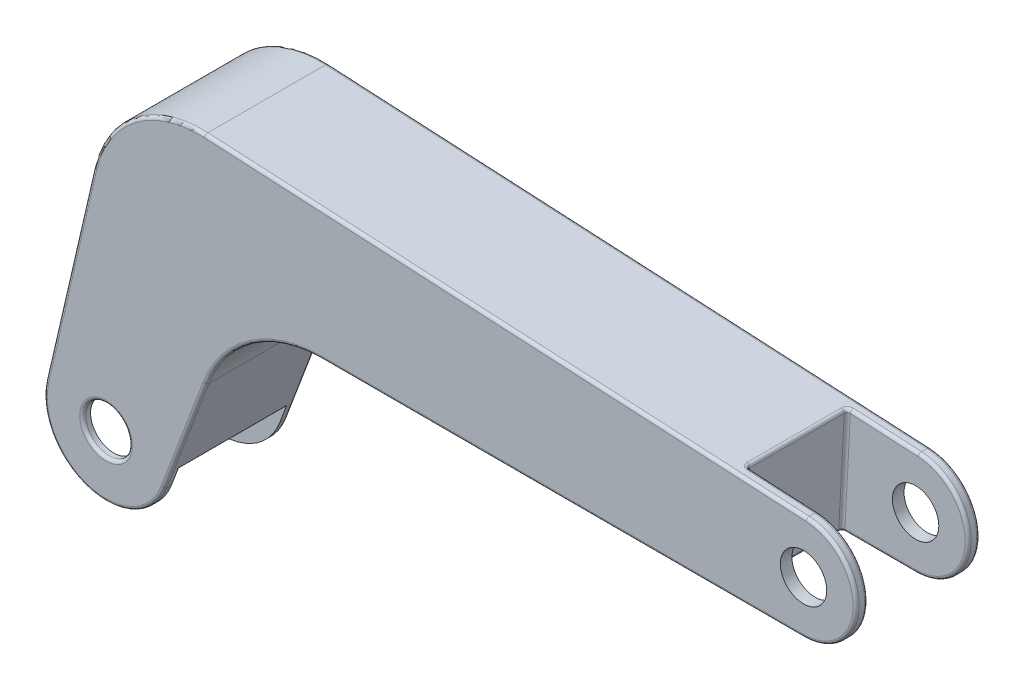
ISO-10303-21;
HEADER;
FILE_DESCRIPTION(('STEP AP214'),'2;1');
FILE_NAME('part.step','',(''),(''),'','','');
FILE_SCHEMA(('AUTOMOTIVE_DESIGN { 1 0 10303 214 1 1 1 1 }'));
ENDSEC;
DATA;
#1=APPLICATION_CONTEXT('core data for automotive mechanical design processes');
#2=APPLICATION_PROTOCOL_DEFINITION('international standard','automotive_design',2000,#1);
#3=PRODUCT_CONTEXT('',#1,'mechanical');
#4=PRODUCT('Part','Part','',(#3));
#5=PRODUCT_RELATED_PRODUCT_CATEGORY('part','',(#4));
#6=PRODUCT_DEFINITION_FORMATION('','',#4);
#7=PRODUCT_DEFINITION_CONTEXT('part definition',#1,'design');
#8=PRODUCT_DEFINITION('design','',#6,#7);
#9=PRODUCT_DEFINITION_SHAPE('','',#8);
#10=(LENGTH_UNIT() NAMED_UNIT(*) SI_UNIT(.MILLI.,.METRE.));
#11=(NAMED_UNIT(*) PLANE_ANGLE_UNIT() SI_UNIT($,.RADIAN.));
#12=(NAMED_UNIT(*) SI_UNIT($,.STERADIAN.) SOLID_ANGLE_UNIT());
#13=UNCERTAINTY_MEASURE_WITH_UNIT(LENGTH_MEASURE(1.E-05),#10,'distance_accuracy_value','');
#14=(GEOMETRIC_REPRESENTATION_CONTEXT(3) GLOBAL_UNCERTAINTY_ASSIGNED_CONTEXT((#13)) GLOBAL_UNIT_ASSIGNED_CONTEXT((#10,
#11,#12)) REPRESENTATION_CONTEXT('',''));
#15=CARTESIAN_POINT('',(0.,0.,0.));
#16=DIRECTION('',(0.,0.,1.));
#17=DIRECTION('',(1.,0.,0.));
#18=AXIS2_PLACEMENT_3D('',#15,#16,#17);
#19=CARTESIAN_POINT('',(188.752550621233,-2.51953504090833,80.));
#20=DIRECTION('',(0.,0.,-1.));
#21=DIRECTION('',(-1.,0.,0.));
#22=AXIS2_PLACEMENT_3D('',#19,#20,#21);
#23=CYLINDRICAL_SURFACE('',#22,34.0534722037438);
#24=DIRECTION('',(0.,0.,-1.));
#25=VECTOR('',#24,1.);
#26=CARTESIAN_POINT('',(190.532695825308,31.487376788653,80.));
#27=LINE('',#26,#25);
#28=CARTESIAN_POINT('',(190.532695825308,31.487376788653,5.50000000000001));
#29=VERTEX_POINT('',#28);
#30=CARTESIAN_POINT('',(190.532695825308,31.487376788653,2.));
#31=VERTEX_POINT('',#30);
#32=EDGE_CURVE('E316',#29,#31,#27,.T.);
#33=ORIENTED_EDGE('',*,*,#32,.F.);
#34=CARTESIAN_POINT('',(188.752550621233,-2.51953504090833,5.50000000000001));
#35=DIRECTION('',(0.,0.,-1.));
#36=DIRECTION('',(-1.,0.,0.));
#37=AXIS2_PLACEMENT_3D('',#34,#35,#36);
#38=CIRCLE('',#37,34.0534722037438);
#39=CARTESIAN_POINT('',(188.752550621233,-36.5730072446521,5.50000000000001));
#40=VERTEX_POINT('',#39);
#41=EDGE_CURVE('E516',#29,#40,#38,.T.);
#42=ORIENTED_EDGE('',*,*,#41,.T.);
#43=DIRECTION('',(0.,0.,-1.));
#44=VECTOR('',#43,1.);
#45=CARTESIAN_POINT('',(188.752550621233,-36.5730072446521,80.));
#46=LINE('',#45,#44);
#47=CARTESIAN_POINT('',(188.752550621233,-36.5730072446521,2.));
#48=VERTEX_POINT('',#47);
#49=EDGE_CURVE('E320',#48,#40,#46,.F.);
#50=ORIENTED_EDGE('',*,*,#49,.F.);
#51=CARTESIAN_POINT('',(188.752550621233,-2.51953504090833,2.));
#52=DIRECTION('',(0.,0.,1.));
#53=DIRECTION('',(1.,0.,0.));
#54=AXIS2_PLACEMENT_3D('',#51,#52,#53);
#55=CIRCLE('',#54,34.0534722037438);
#56=EDGE_CURVE('E397',#48,#31,#55,.T.);
#57=ORIENTED_EDGE('',*,*,#56,.T.);
#58=EDGE_LOOP('',(#33,#42,#50,#57));
#59=FACE_BOUND('',#58,.T.);
#60=ADVANCED_FACE('F46',(#59),#23,.T.);
#61=CARTESIAN_POINT('',(188.752550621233,-36.5730072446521,74.5));
#62=VERTEX_POINT('',#61);
#63=CARTESIAN_POINT('',(188.752550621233,-36.5730072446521,78.));
#64=VERTEX_POINT('',#63);
#65=EDGE_CURVE('E319',#62,#64,#46,.F.);
#66=ORIENTED_EDGE('',*,*,#65,.F.);
#67=CARTESIAN_POINT('',(188.752550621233,-2.51953504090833,74.5));
#68=DIRECTION('',(0.,0.,1.));
#69=DIRECTION('',(1.,0.,0.));
#70=AXIS2_PLACEMENT_3D('',#67,#68,#69);
#71=CIRCLE('',#70,34.0534722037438);
#72=CARTESIAN_POINT('',(190.532695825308,31.487376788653,74.5));
#73=VERTEX_POINT('',#72);
#74=EDGE_CURVE('E518',#62,#73,#71,.T.);
#75=ORIENTED_EDGE('',*,*,#74,.T.);
#76=CARTESIAN_POINT('',(190.532695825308,31.487376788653,78.));
#77=VERTEX_POINT('',#76);
#78=EDGE_CURVE('E317',#77,#73,#27,.T.);
#79=ORIENTED_EDGE('',*,*,#78,.F.);
#80=CARTESIAN_POINT('',(188.752550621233,-2.51953504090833,78.));
#81=DIRECTION('',(0.,0.,1.));
#82=DIRECTION('',(1.,0.,0.));
#83=AXIS2_PLACEMENT_3D('',#80,#81,#82);
#84=CIRCLE('',#83,34.0534722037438);
#85=EDGE_CURVE('E394',#77,#64,#84,.F.);
#86=ORIENTED_EDGE('',*,*,#85,.T.);
#87=EDGE_LOOP('',(#66,#75,#79,#86));
#88=FACE_BOUND('',#87,.T.);
#89=ADVANCED_FACE('F731',(#88),#23,.T.);
#90=CARTESIAN_POINT('',(-262.472978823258,-146.080698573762,80.));
#91=DIRECTION('',(0.,0.,-1.));
#92=DIRECTION('',(-1.,0.,0.));
#93=AXIS2_PLACEMENT_3D('',#90,#91,#92);
#94=CYLINDRICAL_SURFACE('',#93,40.);
#95=CARTESIAN_POINT('',(-262.472978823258,-146.080698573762,5.));
#96=DIRECTION('',(0.,0.,1.));
#97=DIRECTION('',(1.,0.,0.));
#98=AXIS2_PLACEMENT_3D('',#95,#96,#97);
#99=CIRCLE('',#98,40.);
#100=CARTESIAN_POINT('',(-222.519238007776,-148.003871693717,5.));
#101=VERTEX_POINT('',#100);
#102=CARTESIAN_POINT('',(-296.778122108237,-125.509914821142,5.));
#103=VERTEX_POINT('',#102);
#104=EDGE_CURVE('E294',#101,#103,#99,.T.);
#105=ORIENTED_EDGE('',*,*,#104,.F.);
#106=DIRECTION('',(0.,0.,-1.));
#107=VECTOR('',#106,1.);
#108=CARTESIAN_POINT('',(-222.519238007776,-148.003871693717,80.));
#109=LINE('',#108,#107);
#110=CARTESIAN_POINT('',(-222.519238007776,-148.003871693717,75.));
#111=VERTEX_POINT('',#110);
#112=EDGE_CURVE('E288',#101,#111,#109,.F.);
#113=ORIENTED_EDGE('',*,*,#112,.T.);
#114=CARTESIAN_POINT('',(-262.472978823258,-146.080698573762,75.));
#115=DIRECTION('',(0.,0.,1.));
#116=DIRECTION('',(1.,0.,0.));
#117=AXIS2_PLACEMENT_3D('',#114,#115,#116);
#118=CIRCLE('',#117,40.);
#119=CARTESIAN_POINT('',(-296.778122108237,-125.509914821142,75.));
#120=VERTEX_POINT('',#119);
#121=EDGE_CURVE('E847',#111,#120,#118,.T.);
#122=ORIENTED_EDGE('',*,*,#121,.T.);
#123=DIRECTION('',(0.,0.,-1.));
#124=VECTOR('',#123,1.);
#125=CARTESIAN_POINT('',(-296.778122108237,-125.509914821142,80.));
#126=LINE('',#125,#124);
#127=EDGE_CURVE('E323',#120,#103,#126,.T.);
#128=ORIENTED_EDGE('',*,*,#127,.T.);
#129=EDGE_LOOP('',(#105,#113,#122,#128));
#130=FACE_BOUND('',#129,.T.);
#131=ADVANCED_FACE('F773',(#130),#94,.F.);
#132=CARTESIAN_POINT('',(-143.838202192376,54.4252656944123,80.));
#133=DIRECTION('',(-0.935286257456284,0.353892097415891,0.));
#134=DIRECTION('',(-0.353892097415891,-0.935286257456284,0.));
#135=AXIS2_PLACEMENT_3D('',#132,#133,#134);
#136=PLANE('',#135);
#137=DIRECTION('',(0.,0.,-1.));
#138=VECTOR('',#137,1.);
#139=CARTESIAN_POINT('',(-225.061528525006,-160.236382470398,5.));
#140=LINE('',#139,#138);
#141=CARTESIAN_POINT('',(-225.061528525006,-160.236382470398,2.));
#142=VERTEX_POINT('',#141);
#143=CARTESIAN_POINT('',(-225.061528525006,-160.236382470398,5.));
#144=VERTEX_POINT('',#143);
#145=EDGE_CURVE('E267',#142,#144,#140,.F.);
#146=ORIENTED_EDGE('',*,*,#145,.F.);
#147=DIRECTION('',(0.353892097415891,0.935286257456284,0.));
#148=VECTOR('',#147,1.);
#149=CARTESIAN_POINT('',(-143.838202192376,54.4252656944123,2.));
#150=LINE('',#149,#148);
#151=CARTESIAN_POINT('',(-197.82784197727,-88.2616394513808,2.));
#152=VERTEX_POINT('',#151);
#153=EDGE_CURVE('E383',#142,#152,#150,.T.);
#154=ORIENTED_EDGE('',*,*,#153,.T.);
#155=DIRECTION('',(0.,0.,-1.));
#156=VECTOR('',#155,1.);
#157=CARTESIAN_POINT('',(-197.82784197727,-88.2616394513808,80.));
#158=LINE('',#157,#156);
#159=CARTESIAN_POINT('',(-197.82784197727,-88.2616394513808,78.));
#160=VERTEX_POINT('',#159);
#161=EDGE_CURVE('E307',#152,#160,#158,.F.);
#162=ORIENTED_EDGE('',*,*,#161,.T.);
#163=DIRECTION('',(0.353892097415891,0.935286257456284,0.));
#164=VECTOR('',#163,1.);
#165=CARTESIAN_POINT('',(-225.061528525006,-160.236382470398,78.));
#166=LINE('',#165,#164);
#167=CARTESIAN_POINT('',(-225.061528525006,-160.236382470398,78.));
#168=VERTEX_POINT('',#167);
#169=EDGE_CURVE('E381',#160,#168,#166,.F.);
#170=ORIENTED_EDGE('',*,*,#169,.T.);
#171=DIRECTION('',(0.,0.,-1.));
#172=VECTOR('',#171,1.);
#173=CARTESIAN_POINT('',(-225.061528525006,-160.236382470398,80.));
#174=LINE('',#173,#172);
#175=CARTESIAN_POINT('',(-225.061528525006,-160.236382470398,75.));
#176=VERTEX_POINT('',#175);
#177=EDGE_CURVE('E302',#168,#176,#174,.T.);
#178=ORIENTED_EDGE('',*,*,#177,.T.);
#179=DIRECTION('',(0.353892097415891,0.935286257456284,0.));
#180=VECTOR('',#179,1.);
#181=CARTESIAN_POINT('',(-143.838202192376,54.4252656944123,75.));
#182=LINE('',#181,#180);
#183=CARTESIAN_POINT('',(-220.585108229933,-148.405843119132,75.));
#184=VERTEX_POINT('',#183);
#185=EDGE_CURVE('E343',#176,#184,#182,.T.);
#186=ORIENTED_EDGE('',*,*,#185,.T.);
#187=DIRECTION('',(0.,0.,1.));
#188=VECTOR('',#187,1.);
#189=CARTESIAN_POINT('',(-220.585108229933,-148.405843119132,5.));
#190=LINE('',#189,#188);
#191=CARTESIAN_POINT('',(-220.585108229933,-148.405843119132,5.));
#192=VERTEX_POINT('',#191);
#193=EDGE_CURVE('E286',#184,#192,#190,.F.);
#194=ORIENTED_EDGE('',*,*,#193,.T.);
#195=DIRECTION('',(-0.353892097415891,-0.935286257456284,0.));
#196=VECTOR('',#195,1.);
#197=CARTESIAN_POINT('',(-143.838202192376,54.4252656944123,5.));
#198=LINE('',#197,#196);
#199=EDGE_CURVE('E282',#192,#144,#198,.T.);
#200=ORIENTED_EDGE('',*,*,#199,.T.);
#201=EDGE_LOOP('',(#146,#154,#162,#170,#178,#186,#194,#200));
#202=FACE_BOUND('',#201,.T.);
#203=ADVANCED_FACE('F283',(#202),#136,.F.);
#204=CARTESIAN_POINT('',(0.,-36.5730072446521,80.));
#205=DIRECTION('',(0.,1.,0.));
#206=DIRECTION('',(0.,0.,1.));
#207=AXIS2_PLACEMENT_3D('',#204,#205,#206);
#208=PLANE('',#207);
#209=ORIENTED_EDGE('',*,*,#49,.T.);
#210=DIRECTION('',(-1.,0.,0.));
#211=VECTOR('',#210,1.);
#212=CARTESIAN_POINT('',(0.,-36.5730072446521,5.50000000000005));
#213=LINE('',#212,#211);
#214=CARTESIAN_POINT('',(143.067964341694,-36.5730072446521,5.50000000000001));
#215=VERTEX_POINT('',#214);
#216=EDGE_CURVE('E487',#40,#215,#213,.T.);
#217=ORIENTED_EDGE('',*,*,#216,.T.);
#218=CARTESIAN_POINT('',(143.067964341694,-36.5730072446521,9.50000000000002));
#219=DIRECTION('',(0.,1.,0.));
#220=DIRECTION('',(-1.,0.,0.));
#221=AXIS2_PLACEMENT_3D('',#218,#219,#220);
#222=ELLIPSE('',#221,4.0054765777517,4.);
#223=CARTESIAN_POINT('',(139.062487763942,-36.5730072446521,9.50000000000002));
#224=VERTEX_POINT('',#223);
#225=EDGE_CURVE('E484',#224,#215,#222,.F.);
#226=ORIENTED_EDGE('',*,*,#225,.F.);
#227=DIRECTION('',(0.,0.,1.));
#228=VECTOR('',#227,1.);
#229=CARTESIAN_POINT('',(139.062487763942,-36.5730072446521,80.));
#230=LINE('',#229,#228);
#231=CARTESIAN_POINT('',(139.062487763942,-36.5730072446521,70.5));
#232=VERTEX_POINT('',#231);
#233=EDGE_CURVE('E481',#224,#232,#230,.T.);
#234=ORIENTED_EDGE('',*,*,#233,.T.);
#235=CARTESIAN_POINT('',(143.067964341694,-36.5730072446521,70.5));
#236=DIRECTION('',(0.,1.,0.));
#237=DIRECTION('',(-1.,0.,0.));
#238=AXIS2_PLACEMENT_3D('',#235,#236,#237);
#239=ELLIPSE('',#238,4.0054765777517,4.);
#240=CARTESIAN_POINT('',(143.067964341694,-36.5730072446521,74.5));
#241=VERTEX_POINT('',#240);
#242=EDGE_CURVE('E478',#241,#232,#239,.F.);
#243=ORIENTED_EDGE('',*,*,#242,.F.);
#244=DIRECTION('',(1.,0.,0.));
#245=VECTOR('',#244,1.);
#246=CARTESIAN_POINT('',(0.,-36.5730072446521,74.5));
#247=LINE('',#246,#245);
#248=EDGE_CURVE('E432',#241,#62,#247,.T.);
#249=ORIENTED_EDGE('',*,*,#248,.T.);
#250=ORIENTED_EDGE('',*,*,#65,.T.);
#251=DIRECTION('',(1.,0.,0.));
#252=VECTOR('',#251,1.);
#253=CARTESIAN_POINT('',(-123.004941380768,-36.5730072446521,78.));
#254=LINE('',#253,#252);
#255=CARTESIAN_POINT('',(-123.004941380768,-36.5730072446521,78.));
#256=VERTEX_POINT('',#255);
#257=EDGE_CURVE('E390',#64,#256,#254,.F.);
#258=ORIENTED_EDGE('',*,*,#257,.T.);
#259=DIRECTION('',(0.,0.,-1.));
#260=VECTOR('',#259,1.);
#261=CARTESIAN_POINT('',(-123.004941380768,-36.5730072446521,0.));
#262=LINE('',#261,#260);
#263=CARTESIAN_POINT('',(-123.004941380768,-36.5730072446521,2.));
#264=VERTEX_POINT('',#263);
#265=EDGE_CURVE('E304',#256,#264,#262,.T.);
#266=ORIENTED_EDGE('',*,*,#265,.T.);
#267=DIRECTION('',(1.,0.,0.));
#268=VECTOR('',#267,1.);
#269=CARTESIAN_POINT('',(0.,-36.5730072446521,2.));
#270=LINE('',#269,#268);
#271=EDGE_CURVE('E392',#264,#48,#270,.T.);
#272=ORIENTED_EDGE('',*,*,#271,.T.);
#273=EDGE_LOOP('',(#209,#217,#226,#234,#243,#249,#250,#258,#266,#272));
#274=FACE_BOUND('',#273,.T.);
#275=ADVANCED_FACE('F554',(#274),#208,.F.);
#276=CARTESIAN_POINT('',(2.16441605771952,41.34781020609,80.));
#277=DIRECTION('',(-0.0522749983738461,-0.998632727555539,0.));
#278=DIRECTION('',(0.998632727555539,-0.0522749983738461,0.));
#279=AXIS2_PLACEMENT_3D('',#276,#277,#278);
#280=PLANE('',#279);
#281=CARTESIAN_POINT('',(146.646254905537,33.7846814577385,9.50000000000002));
#282=DIRECTION('',(-0.0522749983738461,-0.998632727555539,0.));
#283=DIRECTION('',(0.998632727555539,-0.0522749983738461,0.));
#284=AXIS2_PLACEMENT_3D('',#281,#282,#283);
#285=CIRCLE('',#284,4.);
#286=CARTESIAN_POINT('',(146.646254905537,33.7846814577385,5.50000000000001));
#287=VERTEX_POINT('',#286);
#288=CARTESIAN_POINT('',(142.651723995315,33.9937814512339,9.50000000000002));
#289=VERTEX_POINT('',#288);
#290=EDGE_CURVE('E520',#287,#289,#285,.F.);
#291=ORIENTED_EDGE('',*,*,#290,.F.);
#292=DIRECTION('',(0.998632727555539,-0.0522749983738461,0.));
#293=VECTOR('',#292,1.);
#294=CARTESIAN_POINT('',(2.1644160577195,41.34781020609,5.50000000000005));
#295=LINE('',#294,#293);
#296=EDGE_CURVE('E12',#287,#29,#295,.T.);
#297=ORIENTED_EDGE('',*,*,#296,.T.);
#298=ORIENTED_EDGE('',*,*,#32,.T.);
#299=DIRECTION('',(-0.998632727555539,0.0522749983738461,0.));
#300=VECTOR('',#299,1.);
#301=CARTESIAN_POINT('',(2.16441605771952,41.34781020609,2.));
#302=LINE('',#301,#300);
#303=CARTESIAN_POINT('',(-198.519003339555,51.8528989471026,2.));
#304=VERTEX_POINT('',#303);
#305=EDGE_CURVE('E402',#31,#304,#302,.T.);
#306=ORIENTED_EDGE('',*,*,#305,.T.);
#307=DIRECTION('',(0.,0.,-1.));
#308=VECTOR('',#307,1.);
#309=CARTESIAN_POINT('',(-198.519003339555,51.8528989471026,80.));
#310=LINE('',#309,#308);
#311=CARTESIAN_POINT('',(-198.519003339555,51.8528989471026,78.));
#312=VERTEX_POINT('',#311);
#313=EDGE_CURVE('E313',#304,#312,#310,.F.);
#314=ORIENTED_EDGE('',*,*,#313,.T.);
#315=DIRECTION('',(-0.998632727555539,0.0522749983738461,0.));
#316=VECTOR('',#315,1.);
#317=CARTESIAN_POINT('',(190.532695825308,31.487376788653,78.));
#318=LINE('',#317,#316);
#319=EDGE_CURVE('E400',#312,#77,#318,.F.);
#320=ORIENTED_EDGE('',*,*,#319,.T.);
#321=ORIENTED_EDGE('',*,*,#78,.T.);
#322=DIRECTION('',(0.998632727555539,-0.0522749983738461,0.));
#323=VECTOR('',#322,1.);
#324=CARTESIAN_POINT('',(2.16441605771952,41.34781020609,74.5));
#325=LINE('',#324,#323);
#326=CARTESIAN_POINT('',(146.646254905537,33.7846814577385,74.5));
#327=VERTEX_POINT('',#326);
#328=EDGE_CURVE('E55',#73,#327,#325,.F.);
#329=ORIENTED_EDGE('',*,*,#328,.T.);
#330=CARTESIAN_POINT('',(146.646254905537,33.7846814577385,70.5));
#331=DIRECTION('',(-0.0522749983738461,-0.998632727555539,0.));
#332=DIRECTION('',(0.998632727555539,-0.0522749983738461,0.));
#333=AXIS2_PLACEMENT_3D('',#330,#331,#332);
#334=CIRCLE('',#333,4.);
#335=CARTESIAN_POINT('',(142.651723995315,33.9937814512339,70.5));
#336=VERTEX_POINT('',#335);
#337=EDGE_CURVE('E67',#336,#327,#334,.F.);
#338=ORIENTED_EDGE('',*,*,#337,.F.);
#339=DIRECTION('',(0.,0.,1.));
#340=VECTOR('',#339,1.);
#341=CARTESIAN_POINT('',(142.651723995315,33.9937814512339,80.));
#342=LINE('',#341,#340);
#343=EDGE_CURVE('E523',#336,#289,#342,.F.);
#344=ORIENTED_EDGE('',*,*,#343,.T.);
#345=EDGE_LOOP('',(#291,#297,#298,#306,#314,#320,#321,#329,#338,#344));
#346=FACE_BOUND('',#345,.T.);
#347=ADVANCED_FACE('F559',(#346),#280,.F.);
#348=CARTESIAN_POINT('',(-256.241132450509,59.0585045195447,80.));
#349=DIRECTION('',(-0.974452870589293,0.22459208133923,0.));
#350=DIRECTION('',(-0.22459208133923,-0.974452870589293,0.));
#351=AXIS2_PLACEMENT_3D('',#348,#349,#350);
#352=PLANE('',#351);
#353=DIRECTION('',(0.,0.,-1.));
#354=VECTOR('',#353,1.);
#355=CARTESIAN_POINT('',(-270.389954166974,-2.32994628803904,0.));
#356=LINE('',#355,#354);
#357=CARTESIAN_POINT('',(-270.389954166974,-2.32994628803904,78.));
#358=VERTEX_POINT('',#357);
#359=CARTESIAN_POINT('',(-270.389954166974,-2.32994628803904,2.));
#360=VERTEX_POINT('',#359);
#361=EDGE_CURVE('E310',#358,#360,#356,.T.);
#362=ORIENTED_EDGE('',*,*,#361,.T.);
#363=DIRECTION('',(0.22459208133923,0.974452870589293,0.));
#364=VECTOR('',#363,1.);
#365=CARTESIAN_POINT('',(-301.45109364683,-137.097015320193,2.));
#366=LINE('',#365,#364);
#367=CARTESIAN_POINT('',(-301.451093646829,-137.097015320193,2.));
#368=VERTEX_POINT('',#367);
#369=EDGE_CURVE('E378',#360,#368,#366,.F.);
#370=ORIENTED_EDGE('',*,*,#369,.T.);
#371=DIRECTION('',(0.,0.,-1.));
#372=VECTOR('',#371,1.);
#373=CARTESIAN_POINT('',(-301.451093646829,-137.097015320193,5.));
#374=LINE('',#373,#372);
#375=CARTESIAN_POINT('',(-301.45109364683,-137.097015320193,5.));
#376=VERTEX_POINT('',#375);
#377=EDGE_CURVE('E278',#368,#376,#374,.F.);
#378=ORIENTED_EDGE('',*,*,#377,.T.);
#379=DIRECTION('',(0.22459208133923,0.974452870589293,0.));
#380=VECTOR('',#379,1.);
#381=CARTESIAN_POINT('',(-256.241132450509,59.0585045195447,5.));
#382=LINE('',#381,#380);
#383=CARTESIAN_POINT('',(-298.610203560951,-124.771053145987,5.));
#384=VERTEX_POINT('',#383);
#385=EDGE_CURVE('E293',#376,#384,#382,.T.);
#386=ORIENTED_EDGE('',*,*,#385,.T.);
#387=DIRECTION('',(0.,0.,-1.));
#388=VECTOR('',#387,1.);
#389=CARTESIAN_POINT('',(-298.610203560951,-124.771053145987,80.));
#390=LINE('',#389,#388);
#391=CARTESIAN_POINT('',(-298.610203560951,-124.771053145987,75.));
#392=VERTEX_POINT('',#391);
#393=EDGE_CURVE('E334',#384,#392,#390,.F.);
#394=ORIENTED_EDGE('',*,*,#393,.T.);
#395=DIRECTION('',(-0.22459208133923,-0.974452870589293,0.));
#396=VECTOR('',#395,1.);
#397=CARTESIAN_POINT('',(-301.45109364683,-137.097015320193,75.));
#398=LINE('',#397,#396);
#399=CARTESIAN_POINT('',(-301.45109364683,-137.097015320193,75.));
#400=VERTEX_POINT('',#399);
#401=EDGE_CURVE('E331',#392,#400,#398,.T.);
#402=ORIENTED_EDGE('',*,*,#401,.T.);
#403=DIRECTION('',(0.,0.,-1.));
#404=VECTOR('',#403,1.);
#405=CARTESIAN_POINT('',(-301.45109364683,-137.097015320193,80.));
#406=LINE('',#405,#404);
#407=CARTESIAN_POINT('',(-301.45109364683,-137.097015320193,78.));
#408=VERTEX_POINT('',#407);
#409=EDGE_CURVE('E277',#408,#400,#406,.T.);
#410=ORIENTED_EDGE('',*,*,#409,.F.);
#411=DIRECTION('',(0.22459208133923,0.974452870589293,0.));
#412=VECTOR('',#411,1.);
#413=CARTESIAN_POINT('',(-256.241132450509,59.0585045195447,78.));
#414=LINE('',#413,#412);
#415=EDGE_CURVE('E376',#408,#358,#414,.T.);
#416=ORIENTED_EDGE('',*,*,#415,.T.);
#417=EDGE_LOOP('',(#362,#370,#378,#386,#394,#402,#410,#416));
#418=FACE_BOUND('',#417,.T.);
#419=ADVANCED_FACE('F660',(#418),#352,.T.);
#420=CARTESIAN_POINT('',(0.,0.,80.));
#421=DIRECTION('',(0.,0.,1.));
#422=DIRECTION('',(1.,0.,0.));
#423=AXIS2_PLACEMENT_3D('',#420,#421,#422);
#424=PLANE('',#423);
#425=CARTESIAN_POINT('',(188.752550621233,-2.51953504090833,80.));
#426=DIRECTION('',(0.,0.,1.));
#427=DIRECTION('',(1.,0.,0.));
#428=AXIS2_PLACEMENT_3D('',#425,#426,#427);
#429=CIRCLE('',#428,15.);
#430=CARTESIAN_POINT('',(203.752550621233,-2.51953504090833,80.));
#431=VERTEX_POINT('',#430);
#432=EDGE_CURVE('E859',#431,#431,#429,.T.);
#433=ORIENTED_EDGE('',*,*,#432,.F.);
#434=EDGE_LOOP('',(#433));
#435=FACE_BOUND('',#434,.T.);
#436=DIRECTION('',(0.353892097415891,0.935286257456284,0.));
#437=VECTOR('',#436,1.);
#438=CARTESIAN_POINT('',(-199.698414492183,-87.5538552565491,80.));
#439=LINE('',#438,#437);
#440=CARTESIAN_POINT('',(-226.932101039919,-159.528598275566,80.));
#441=VERTEX_POINT('',#440);
#442=CARTESIAN_POINT('',(-199.698414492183,-87.553855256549,80.));
#443=VERTEX_POINT('',#442);
#444=EDGE_CURVE('E422',#441,#443,#439,.T.);
#445=ORIENTED_EDGE('',*,*,#444,.T.);
#446=CARTESIAN_POINT('',(-123.004941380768,-116.573007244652,80.));
#447=DIRECTION('',(0.,0.,1.));
#448=DIRECTION('',(1.,0.,0.));
#449=AXIS2_PLACEMENT_3D('',#446,#447,#448);
#450=CIRCLE('',#449,82.);
#451=CARTESIAN_POINT('',(-123.004941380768,-34.5730072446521,80.));
#452=VERTEX_POINT('',#451);
#453=EDGE_CURVE('E424',#443,#452,#450,.F.);
#454=ORIENTED_EDGE('',*,*,#453,.T.);
#455=DIRECTION('',(1.,0.,0.));
#456=VECTOR('',#455,1.);
#457=CARTESIAN_POINT('',(188.752550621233,-34.5730072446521,80.));
#458=LINE('',#457,#456);
#459=CARTESIAN_POINT('',(188.752550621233,-34.5730072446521,80.));
#460=VERTEX_POINT('',#459);
#461=EDGE_CURVE('E410',#452,#460,#458,.T.);
#462=ORIENTED_EDGE('',*,*,#461,.T.);
#463=CARTESIAN_POINT('',(188.752550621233,-2.51953504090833,80.));
#464=DIRECTION('',(0.,0.,1.));
#465=DIRECTION('',(1.,0.,0.));
#466=AXIS2_PLACEMENT_3D('',#463,#464,#465);
#467=CIRCLE('',#466,32.0534722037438);
#468=CARTESIAN_POINT('',(190.42814582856,29.4901113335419,80.));
#469=VERTEX_POINT('',#468);
#470=EDGE_CURVE('E412',#460,#469,#467,.T.);
#471=ORIENTED_EDGE('',*,*,#470,.T.);
#472=DIRECTION('',(-0.998632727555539,0.0522749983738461,0.));
#473=VECTOR('',#472,1.);
#474=CARTESIAN_POINT('',(-198.623553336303,49.8556334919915,80.));
#475=LINE('',#474,#473);
#476=CARTESIAN_POINT('',(-198.623553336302,49.8556334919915,80.));
#477=VERTEX_POINT('',#476);
#478=EDGE_CURVE('E414',#469,#477,#475,.T.);
#479=ORIENTED_EDGE('',*,*,#478,.T.);
#480=CARTESIAN_POINT('',(-202.178253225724,-18.0513919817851,80.));
#481=DIRECTION('',(0.,0.,1.));
#482=DIRECTION('',(1.,0.,0.));
#483=AXIS2_PLACEMENT_3D('',#480,#481,#482);
#484=CIRCLE('',#483,68.);
#485=CARTESIAN_POINT('',(-268.441048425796,-2.77913045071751,80.));
#486=VERTEX_POINT('',#485);
#487=EDGE_CURVE('E416',#477,#486,#484,.T.);
#488=ORIENTED_EDGE('',*,*,#487,.T.);
#489=DIRECTION('',(0.22459208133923,0.974452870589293,0.));
#490=VECTOR('',#489,1.);
#491=CARTESIAN_POINT('',(-254.29222670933,58.6093203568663,80.));
#492=LINE('',#491,#490);
#493=CARTESIAN_POINT('',(-299.502187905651,-137.546199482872,80.));
#494=VERTEX_POINT('',#493);
#495=EDGE_CURVE('E418',#486,#494,#492,.F.);
#496=ORIENTED_EDGE('',*,*,#495,.T.);
#497=CARTESIAN_POINT('',(-262.472978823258,-146.080698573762,80.));
#498=DIRECTION('',(0.,0.,1.));
#499=DIRECTION('',(1.,0.,0.));
#500=AXIS2_PLACEMENT_3D('',#497,#498,#499);
#501=CIRCLE('',#500,38.);
#502=EDGE_CURVE('E420',#494,#441,#501,.T.);
#503=ORIENTED_EDGE('',*,*,#502,.T.);
#504=EDGE_LOOP('',(#445,#454,#462,#471,#479,#488,#496,#503));
#505=FACE_BOUND('',#504,.T.);
#506=CARTESIAN_POINT('',(-262.472978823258,-146.080698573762,80.));
#507=DIRECTION('',(0.,0.,1.));
#508=DIRECTION('',(1.,0.,0.));
#509=AXIS2_PLACEMENT_3D('',#506,#507,#508);
#510=CIRCLE('',#509,17.);
#511=CARTESIAN_POINT('',(-245.472978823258,-146.080698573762,80.));
#512=VERTEX_POINT('',#511);
#513=EDGE_CURVE('E407',#512,#512,#510,.F.);
#514=ORIENTED_EDGE('',*,*,#513,.T.);
#515=EDGE_LOOP('',(#514));
#516=FACE_BOUND('',#515,.T.);
#517=ADVANCED_FACE('F696',(#435,#505,#516),#424,.T.);
#518=CARTESIAN_POINT('',(0.,0.,0.));
#519=DIRECTION('',(0.,0.,1.));
#520=DIRECTION('',(1.,0.,0.));
#521=AXIS2_PLACEMENT_3D('',#518,#519,#520);
#522=PLANE('',#521);
#523=CARTESIAN_POINT('',(188.752550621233,-2.51953504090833,0.));
#524=DIRECTION('',(0.,0.,1.));
#525=DIRECTION('',(1.,0.,0.));
#526=AXIS2_PLACEMENT_3D('',#523,#524,#525);
#527=CIRCLE('',#526,15.);
#528=CARTESIAN_POINT('',(203.752550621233,-2.51953504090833,0.));
#529=VERTEX_POINT('',#528);
#530=EDGE_CURVE('E530',#529,#529,#527,.T.);
#531=ORIENTED_EDGE('',*,*,#530,.T.);
#532=EDGE_LOOP('',(#531));
#533=FACE_BOUND('',#532,.T.);
#534=DIRECTION('',(0.22459208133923,0.974452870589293,0.));
#535=VECTOR('',#534,1.);
#536=CARTESIAN_POINT('',(-268.441048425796,-2.77913045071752,0.));
#537=LINE('',#536,#535);
#538=CARTESIAN_POINT('',(-299.502187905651,-137.546199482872,0.));
#539=VERTEX_POINT('',#538);
#540=CARTESIAN_POINT('',(-268.441048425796,-2.7791304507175,0.));
#541=VERTEX_POINT('',#540);
#542=EDGE_CURVE('E366',#539,#541,#537,.T.);
#543=ORIENTED_EDGE('',*,*,#542,.T.);
#544=CARTESIAN_POINT('',(-202.178253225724,-18.0513919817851,0.));
#545=DIRECTION('',(0.,0.,1.));
#546=DIRECTION('',(1.,0.,0.));
#547=AXIS2_PLACEMENT_3D('',#544,#545,#546);
#548=CIRCLE('',#547,68.);
#549=CARTESIAN_POINT('',(-198.623553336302,49.8556334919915,0.));
#550=VERTEX_POINT('',#549);
#551=EDGE_CURVE('E368',#541,#550,#548,.F.);
#552=ORIENTED_EDGE('',*,*,#551,.T.);
#553=DIRECTION('',(-0.998632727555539,0.0522749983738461,0.));
#554=VECTOR('',#553,1.);
#555=CARTESIAN_POINT('',(2.05986606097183,39.3505447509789,0.));
#556=LINE('',#555,#554);
#557=CARTESIAN_POINT('',(190.42814582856,29.4901113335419,0.));
#558=VERTEX_POINT('',#557);
#559=EDGE_CURVE('E354',#550,#558,#556,.F.);
#560=ORIENTED_EDGE('',*,*,#559,.T.);
#561=CARTESIAN_POINT('',(188.752550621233,-2.51953504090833,0.));
#562=DIRECTION('',(0.,0.,1.));
#563=DIRECTION('',(1.,0.,0.));
#564=AXIS2_PLACEMENT_3D('',#561,#562,#563);
#565=CIRCLE('',#564,32.0534722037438);
#566=CARTESIAN_POINT('',(188.752550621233,-34.5730072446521,0.));
#567=VERTEX_POINT('',#566);
#568=EDGE_CURVE('E356',#558,#567,#565,.F.);
#569=ORIENTED_EDGE('',*,*,#568,.T.);
#570=DIRECTION('',(1.,0.,0.));
#571=VECTOR('',#570,1.);
#572=CARTESIAN_POINT('',(0.,-34.5730072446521,0.));
#573=LINE('',#572,#571);
#574=CARTESIAN_POINT('',(-123.004941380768,-34.5730072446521,0.));
#575=VERTEX_POINT('',#574);
#576=EDGE_CURVE('E358',#567,#575,#573,.F.);
#577=ORIENTED_EDGE('',*,*,#576,.T.);
#578=CARTESIAN_POINT('',(-123.004941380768,-116.573007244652,0.));
#579=DIRECTION('',(0.,0.,1.));
#580=DIRECTION('',(1.,0.,0.));
#581=AXIS2_PLACEMENT_3D('',#578,#579,#580);
#582=CIRCLE('',#581,82.);
#583=CARTESIAN_POINT('',(-199.698414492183,-87.553855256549,0.));
#584=VERTEX_POINT('',#583);
#585=EDGE_CURVE('E360',#575,#584,#582,.T.);
#586=ORIENTED_EDGE('',*,*,#585,.T.);
#587=DIRECTION('',(0.353892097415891,0.935286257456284,0.));
#588=VECTOR('',#587,1.);
#589=CARTESIAN_POINT('',(-145.708774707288,55.1330498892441,0.));
#590=LINE('',#589,#588);
#591=CARTESIAN_POINT('',(-226.932101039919,-159.528598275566,0.));
#592=VERTEX_POINT('',#591);
#593=EDGE_CURVE('E362',#584,#592,#590,.F.);
#594=ORIENTED_EDGE('',*,*,#593,.T.);
#595=CARTESIAN_POINT('',(-262.472978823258,-146.080698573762,0.));
#596=DIRECTION('',(0.,0.,1.));
#597=DIRECTION('',(1.,0.,0.));
#598=AXIS2_PLACEMENT_3D('',#595,#596,#597);
#599=CIRCLE('',#598,38.);
#600=EDGE_CURVE('E364',#592,#539,#599,.F.);
#601=ORIENTED_EDGE('',*,*,#600,.T.);
#602=EDGE_LOOP('',(#543,#552,#560,#569,#577,#586,#594,#601));
#603=FACE_BOUND('',#602,.T.);
#604=CARTESIAN_POINT('',(-262.472978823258,-146.080698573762,0.));
#605=DIRECTION('',(0.,0.,1.));
#606=DIRECTION('',(1.,0.,0.));
#607=AXIS2_PLACEMENT_3D('',#604,#605,#606);
#608=CIRCLE('',#607,17.);
#609=CARTESIAN_POINT('',(-245.472978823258,-146.080698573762,0.));
#610=VERTEX_POINT('',#609);
#611=EDGE_CURVE('E351',#610,#610,#608,.T.);
#612=ORIENTED_EDGE('',*,*,#611,.T.);
#613=EDGE_LOOP('',(#612));
#614=FACE_BOUND('',#613,.T.);
#615=ADVANCED_FACE('F891',(#533,#603,#614),#522,.F.);
#616=CARTESIAN_POINT('',(-262.472978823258,-146.080698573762,5.));
#617=DIRECTION('',(0.,0.,-1.));
#618=DIRECTION('',(-1.,0.,0.));
#619=AXIS2_PLACEMENT_3D('',#616,#617,#618);
#620=CYLINDRICAL_SURFACE('',#619,40.);
#621=ORIENTED_EDGE('',*,*,#377,.F.);
#622=CARTESIAN_POINT('',(-262.472978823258,-146.080698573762,2.));
#623=DIRECTION('',(0.,0.,1.));
#624=DIRECTION('',(1.,0.,0.));
#625=AXIS2_PLACEMENT_3D('',#622,#623,#624);
#626=CIRCLE('',#625,40.);
#627=EDGE_CURVE('E274',#368,#142,#626,.T.);
#628=ORIENTED_EDGE('',*,*,#627,.T.);
#629=ORIENTED_EDGE('',*,*,#145,.T.);
#630=EDGE_CURVE('E272',#376,#144,#99,.T.);
#631=ORIENTED_EDGE('',*,*,#630,.F.);
#632=EDGE_LOOP('',(#621,#628,#629,#631));
#633=FACE_BOUND('',#632,.T.);
#634=ADVANCED_FACE('F270',(#633),#620,.T.);
#635=CARTESIAN_POINT('',(0.,0.,5.));
#636=DIRECTION('',(0.,0.,1.));
#637=DIRECTION('',(1.,0.,0.));
#638=AXIS2_PLACEMENT_3D('',#635,#636,#637);
#639=PLANE('',#638);
#640=CARTESIAN_POINT('',(-262.472978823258,-146.080698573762,5.));
#641=DIRECTION('',(0.,0.,1.));
#642=DIRECTION('',(1.,0.,0.));
#643=AXIS2_PLACEMENT_3D('',#640,#641,#642);
#644=CIRCLE('',#643,15.);
#645=CARTESIAN_POINT('',(-247.472978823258,-146.080698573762,5.));
#646=VERTEX_POINT('',#645);
#647=EDGE_CURVE('E327',#646,#646,#644,.T.);
#648=ORIENTED_EDGE('',*,*,#647,.F.);
#649=EDGE_LOOP('',(#648));
#650=FACE_BOUND('',#649,.T.);
#651=ORIENTED_EDGE('',*,*,#630,.T.);
#652=ORIENTED_EDGE('',*,*,#199,.F.);
#653=CARTESIAN_POINT('',(-221.520394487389,-148.051951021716,5.));
#654=DIRECTION('',(0.,0.,1.));
#655=DIRECTION('',(1.,0.,0.));
#656=AXIS2_PLACEMENT_3D('',#653,#654,#655);
#657=CIRCLE('',#656,1.);
#658=EDGE_CURVE('E347',#192,#101,#657,.F.);
#659=ORIENTED_EDGE('',*,*,#658,.T.);
#660=ORIENTED_EDGE('',*,*,#104,.T.);
#661=CARTESIAN_POINT('',(-297.635750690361,-124.995645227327,5.));
#662=DIRECTION('',(0.,0.,1.));
#663=DIRECTION('',(1.,0.,0.));
#664=AXIS2_PLACEMENT_3D('',#661,#662,#663);
#665=CIRCLE('',#664,1.);
#666=EDGE_CURVE('E338',#103,#384,#665,.F.);
#667=ORIENTED_EDGE('',*,*,#666,.T.);
#668=ORIENTED_EDGE('',*,*,#385,.F.);
#669=EDGE_LOOP('',(#651,#652,#659,#660,#667,#668));
#670=FACE_BOUND('',#669,.T.);
#671=ADVANCED_FACE('F291',(#650,#670),#639,.T.);
#672=CARTESIAN_POINT('',(-262.472978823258,-146.080698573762,80.));
#673=DIRECTION('',(0.,0.,-1.));
#674=DIRECTION('',(-1.,0.,0.));
#675=AXIS2_PLACEMENT_3D('',#672,#673,#674);
#676=CYLINDRICAL_SURFACE('',#675,40.);
#677=ORIENTED_EDGE('',*,*,#177,.F.);
#678=CARTESIAN_POINT('',(-262.472978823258,-146.080698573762,78.));
#679=DIRECTION('',(0.,0.,1.));
#680=DIRECTION('',(1.,0.,0.));
#681=AXIS2_PLACEMENT_3D('',#678,#679,#680);
#682=CIRCLE('',#681,40.);
#683=EDGE_CURVE('E427',#168,#408,#682,.F.);
#684=ORIENTED_EDGE('',*,*,#683,.T.);
#685=ORIENTED_EDGE('',*,*,#409,.T.);
#686=EDGE_CURVE('E297',#400,#176,#118,.T.);
#687=ORIENTED_EDGE('',*,*,#686,.T.);
#688=EDGE_LOOP('',(#677,#684,#685,#687));
#689=FACE_BOUND('',#688,.T.);
#690=ADVANCED_FACE('F708',(#689),#676,.T.);
#691=CARTESIAN_POINT('',(-262.472978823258,-146.080698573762,75.));
#692=DIRECTION('',(0.,0.,1.));
#693=DIRECTION('',(1.,0.,0.));
#694=AXIS2_PLACEMENT_3D('',#691,#692,#693);
#695=PLANE('',#694);
#696=CARTESIAN_POINT('',(-262.472978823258,-146.080698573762,75.));
#697=DIRECTION('',(0.,0.,1.));
#698=DIRECTION('',(1.,0.,0.));
#699=AXIS2_PLACEMENT_3D('',#696,#697,#698);
#700=CIRCLE('',#699,15.);
#701=CARTESIAN_POINT('',(-247.472978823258,-146.080698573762,75.));
#702=VERTEX_POINT('',#701);
#703=EDGE_CURVE('E324',#702,#702,#700,.T.);
#704=ORIENTED_EDGE('',*,*,#703,.T.);
#705=EDGE_LOOP('',(#704));
#706=FACE_BOUND('',#705,.T.);
#707=ORIENTED_EDGE('',*,*,#686,.F.);
#708=ORIENTED_EDGE('',*,*,#401,.F.);
#709=CARTESIAN_POINT('',(-297.635750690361,-124.995645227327,75.));
#710=DIRECTION('',(0.,0.,1.));
#711=DIRECTION('',(1.,0.,0.));
#712=AXIS2_PLACEMENT_3D('',#709,#710,#711);
#713=CIRCLE('',#712,1.);
#714=EDGE_CURVE('E340',#392,#120,#713,.T.);
#715=ORIENTED_EDGE('',*,*,#714,.T.);
#716=ORIENTED_EDGE('',*,*,#121,.F.);
#717=CARTESIAN_POINT('',(-221.520394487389,-148.051951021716,75.));
#718=DIRECTION('',(0.,0.,1.));
#719=DIRECTION('',(1.,0.,0.));
#720=AXIS2_PLACEMENT_3D('',#717,#718,#719);
#721=CIRCLE('',#720,1.);
#722=EDGE_CURVE('E349',#111,#184,#721,.T.);
#723=ORIENTED_EDGE('',*,*,#722,.T.);
#724=ORIENTED_EDGE('',*,*,#185,.F.);
#725=EDGE_LOOP('',(#707,#708,#715,#716,#723,#724));
#726=FACE_BOUND('',#725,.T.);
#727=ADVANCED_FACE('F843',(#706,#726),#695,.F.);
#728=CARTESIAN_POINT('',(-123.004941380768,-116.573007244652,80.));
#729=DIRECTION('',(0.,0.,1.));
#730=DIRECTION('',(1.,0.,0.));
#731=AXIS2_PLACEMENT_3D('',#728,#729,#730);
#732=CYLINDRICAL_SURFACE('',#731,80.);
#733=ORIENTED_EDGE('',*,*,#161,.F.);
#734=CARTESIAN_POINT('',(-123.004941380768,-116.573007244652,2.));
#735=DIRECTION('',(0.,0.,1.));
#736=DIRECTION('',(1.,0.,0.));
#737=AXIS2_PLACEMENT_3D('',#734,#735,#736);
#738=CIRCLE('',#737,80.);
#739=EDGE_CURVE('E388',#152,#264,#738,.F.);
#740=ORIENTED_EDGE('',*,*,#739,.T.);
#741=ORIENTED_EDGE('',*,*,#265,.F.);
#742=CARTESIAN_POINT('',(-123.004941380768,-116.573007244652,78.));
#743=DIRECTION('',(0.,0.,1.));
#744=DIRECTION('',(1.,0.,0.));
#745=AXIS2_PLACEMENT_3D('',#742,#743,#744);
#746=CIRCLE('',#745,80.);
#747=EDGE_CURVE('E385',#256,#160,#746,.T.);
#748=ORIENTED_EDGE('',*,*,#747,.T.);
#749=EDGE_LOOP('',(#733,#740,#741,#748));
#750=FACE_BOUND('',#749,.T.);
#751=ADVANCED_FACE('F672',(#750),#732,.F.);
#752=CARTESIAN_POINT('',(-202.178253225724,-18.0513919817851,80.));
#753=DIRECTION('',(0.,0.,1.));
#754=DIRECTION('',(1.,0.,0.));
#755=AXIS2_PLACEMENT_3D('',#752,#753,#754);
#756=CYLINDRICAL_SURFACE('',#755,70.);
#757=ORIENTED_EDGE('',*,*,#313,.F.);
#758=CARTESIAN_POINT('',(-202.178253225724,-18.0513919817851,2.));
#759=DIRECTION('',(0.,0.,1.));
#760=DIRECTION('',(1.,0.,0.));
#761=AXIS2_PLACEMENT_3D('',#758,#759,#760);
#762=CIRCLE('',#761,70.);
#763=EDGE_CURVE('E373',#304,#360,#762,.T.);
#764=ORIENTED_EDGE('',*,*,#763,.T.);
#765=ORIENTED_EDGE('',*,*,#361,.F.);
#766=CARTESIAN_POINT('',(-202.178253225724,-18.0513919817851,78.));
#767=DIRECTION('',(0.,0.,1.));
#768=DIRECTION('',(1.,0.,0.));
#769=AXIS2_PLACEMENT_3D('',#766,#767,#768);
#770=CIRCLE('',#769,70.);
#771=EDGE_CURVE('E371',#358,#312,#770,.F.);
#772=ORIENTED_EDGE('',*,*,#771,.T.);
#773=EDGE_LOOP('',(#757,#764,#765,#772));
#774=FACE_BOUND('',#773,.T.);
#775=ADVANCED_FACE('F647',(#774),#756,.T.);
#776=CARTESIAN_POINT('',(-262.472978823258,-146.080698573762,-27.));
#777=DIRECTION('',(0.,0.,1.));
#778=DIRECTION('',(1.,0.,0.));
#779=AXIS2_PLACEMENT_3D('',#776,#777,#778);
#780=CYLINDRICAL_SURFACE('',#779,15.);
#781=CARTESIAN_POINT('',(-262.472978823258,-146.080698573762,78.));
#782=DIRECTION('',(0.,0.,1.));
#783=DIRECTION('',(1.,0.,0.));
#784=AXIS2_PLACEMENT_3D('',#781,#782,#783);
#785=CIRCLE('',#784,15.);
#786=CARTESIAN_POINT('',(-247.472978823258,-146.080698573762,78.));
#787=VERTEX_POINT('',#786);
#788=EDGE_CURVE('E429',#787,#787,#785,.T.);
#789=ORIENTED_EDGE('',*,*,#788,.T.);
#790=EDGE_LOOP('',(#789));
#791=FACE_BOUND('',#790,.T.);
#792=ORIENTED_EDGE('',*,*,#703,.F.);
#793=EDGE_LOOP('',(#792));
#794=FACE_BOUND('',#793,.T.);
#795=ADVANCED_FACE('F837',(#791,#794),#780,.F.);
#796=CARTESIAN_POINT('',(-262.472978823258,-146.080698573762,2.));
#797=DIRECTION('',(0.,0.,1.));
#798=DIRECTION('',(1.,0.,0.));
#799=AXIS2_PLACEMENT_3D('',#796,#797,#798);
#800=CIRCLE('',#799,15.);
#801=CARTESIAN_POINT('',(-247.472978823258,-146.080698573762,2.));
#802=VERTEX_POINT('',#801);
#803=EDGE_CURVE('E404',#802,#802,#800,.F.);
#804=ORIENTED_EDGE('',*,*,#803,.T.);
#805=EDGE_LOOP('',(#804));
#806=FACE_BOUND('',#805,.T.);
#807=ORIENTED_EDGE('',*,*,#647,.T.);
#808=EDGE_LOOP('',(#807));
#809=FACE_BOUND('',#808,.T.);
#810=ADVANCED_FACE('F784',(#806,#809),#780,.F.);
#811=CARTESIAN_POINT('',(-297.635750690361,-124.995645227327,80.));
#812=DIRECTION('',(0.,0.,-1.));
#813=DIRECTION('',(-1.,0.,0.));
#814=AXIS2_PLACEMENT_3D('',#811,#812,#813);
#815=CYLINDRICAL_SURFACE('',#814,1.);
#816=ORIENTED_EDGE('',*,*,#714,.F.);
#817=ORIENTED_EDGE('',*,*,#393,.F.);
#818=ORIENTED_EDGE('',*,*,#666,.F.);
#819=ORIENTED_EDGE('',*,*,#127,.F.);
#820=EDGE_LOOP('',(#816,#817,#818,#819));
#821=FACE_BOUND('',#820,.T.);
#822=ADVANCED_FACE('F780',(#821),#815,.T.);
#823=CARTESIAN_POINT('',(-221.520394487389,-148.051951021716,80.));
#824=DIRECTION('',(0.,0.,-1.));
#825=DIRECTION('',(-1.,0.,0.));
#826=AXIS2_PLACEMENT_3D('',#823,#824,#825);
#827=CYLINDRICAL_SURFACE('',#826,1.);
#828=ORIENTED_EDGE('',*,*,#722,.F.);
#829=ORIENTED_EDGE('',*,*,#112,.F.);
#830=ORIENTED_EDGE('',*,*,#658,.F.);
#831=ORIENTED_EDGE('',*,*,#193,.F.);
#832=EDGE_LOOP('',(#828,#829,#830,#831));
#833=FACE_BOUND('',#832,.T.);
#834=ADVANCED_FACE('F783',(#833),#827,.T.);
#835=CARTESIAN_POINT('',(-123.004941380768,-116.573007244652,2.));
#836=DIRECTION('',(0.,0.,1.));
#837=DIRECTION('',(1.,0.,0.));
#838=AXIS2_PLACEMENT_3D('',#835,#836,#837);
#839=TOROIDAL_SURFACE('',#838,82.,2.);
#840=CARTESIAN_POINT('',(-123.004941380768,-34.5730072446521,2.));
#841=DIRECTION('',(1.,0.,0.));
#842=DIRECTION('',(0.,0.,-1.));
#843=AXIS2_PLACEMENT_3D('',#840,#841,#842);
#844=CIRCLE('',#843,2.);
#845=EDGE_CURVE('E450',#264,#575,#844,.T.);
#846=ORIENTED_EDGE('',*,*,#845,.F.);
#847=ORIENTED_EDGE('',*,*,#739,.F.);
#848=CARTESIAN_POINT('',(-199.698414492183,-87.553855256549,2.));
#849=DIRECTION('',(-0.353892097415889,-0.935286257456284,0.));
#850=DIRECTION('',(0.935286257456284,-0.353892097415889,0.));
#851=AXIS2_PLACEMENT_3D('',#848,#849,#850);
#852=CIRCLE('',#851,2.);
#853=EDGE_CURVE('E328',#584,#152,#852,.T.);
#854=ORIENTED_EDGE('',*,*,#853,.F.);
#855=ORIENTED_EDGE('',*,*,#585,.F.);
#856=EDGE_LOOP('',(#846,#847,#854,#855));
#857=FACE_BOUND('',#856,.T.);
#858=ADVANCED_FACE('F677',(#857),#839,.T.);
#859=CARTESIAN_POINT('',(-145.708774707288,55.1330498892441,2.));
#860=DIRECTION('',(0.353892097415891,0.935286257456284,0.));
#861=DIRECTION('',(-0.935286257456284,0.353892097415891,0.));
#862=AXIS2_PLACEMENT_3D('',#859,#860,#861);
#863=CYLINDRICAL_SURFACE('',#862,2.);
#864=ORIENTED_EDGE('',*,*,#853,.T.);
#865=ORIENTED_EDGE('',*,*,#153,.F.);
#866=CARTESIAN_POINT('',(-226.932101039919,-159.528598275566,2.));
#867=DIRECTION('',(-0.353892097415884,-0.935286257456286,0.));
#868=DIRECTION('',(0.935286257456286,-0.353892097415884,0.));
#869=AXIS2_PLACEMENT_3D('',#866,#867,#868);
#870=CIRCLE('',#869,2.);
#871=EDGE_CURVE('E447',#592,#142,#870,.T.);
#872=ORIENTED_EDGE('',*,*,#871,.F.);
#873=ORIENTED_EDGE('',*,*,#593,.F.);
#874=EDGE_LOOP('',(#864,#865,#872,#873));
#875=FACE_BOUND('',#874,.T.);
#876=ADVANCED_FACE('F667',(#875),#863,.T.);
#877=CARTESIAN_POINT('',(0.,-34.5730072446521,2.));
#878=DIRECTION('',(1.,0.,0.));
#879=DIRECTION('',(0.,0.,-1.));
#880=AXIS2_PLACEMENT_3D('',#877,#878,#879);
#881=CYLINDRICAL_SURFACE('',#880,2.);
#882=ORIENTED_EDGE('',*,*,#845,.T.);
#883=ORIENTED_EDGE('',*,*,#576,.F.);
#884=CARTESIAN_POINT('',(188.752550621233,-34.5730072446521,2.));
#885=DIRECTION('',(1.,0.,0.));
#886=DIRECTION('',(0.,0.,-1.));
#887=AXIS2_PLACEMENT_3D('',#884,#885,#886);
#888=CIRCLE('',#887,2.);
#889=EDGE_CURVE('E444',#48,#567,#888,.T.);
#890=ORIENTED_EDGE('',*,*,#889,.F.);
#891=ORIENTED_EDGE('',*,*,#271,.F.);
#892=EDGE_LOOP('',(#882,#883,#890,#891));
#893=FACE_BOUND('',#892,.T.);
#894=ADVANCED_FACE('F682',(#893),#881,.T.);
#895=CARTESIAN_POINT('',(-262.472978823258,-146.080698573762,2.));
#896=DIRECTION('',(0.,0.,1.));
#897=DIRECTION('',(1.,0.,0.));
#898=AXIS2_PLACEMENT_3D('',#895,#896,#897);
#899=TOROIDAL_SURFACE('',#898,38.,2.);
#900=ORIENTED_EDGE('',*,*,#871,.T.);
#901=ORIENTED_EDGE('',*,*,#627,.F.);
#902=CARTESIAN_POINT('',(-299.502187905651,-137.546199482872,2.));
#903=DIRECTION('',(0.224592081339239,0.974452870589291,0.));
#904=DIRECTION('',(-0.974452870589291,0.224592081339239,0.));
#905=AXIS2_PLACEMENT_3D('',#902,#903,#904);
#906=CIRCLE('',#905,2.);
#907=EDGE_CURVE('E441',#539,#368,#906,.T.);
#908=ORIENTED_EDGE('',*,*,#907,.F.);
#909=ORIENTED_EDGE('',*,*,#600,.F.);
#910=EDGE_LOOP('',(#900,#901,#908,#909));
#911=FACE_BOUND('',#910,.T.);
#912=ADVANCED_FACE('F662',(#911),#899,.T.);
#913=CARTESIAN_POINT('',(188.752550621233,-2.51953504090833,2.));
#914=DIRECTION('',(0.,0.,1.));
#915=DIRECTION('',(1.,0.,0.));
#916=AXIS2_PLACEMENT_3D('',#913,#914,#915);
#917=TOROIDAL_SURFACE('',#916,32.0534722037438,2.);
#918=ORIENTED_EDGE('',*,*,#889,.T.);
#919=ORIENTED_EDGE('',*,*,#568,.F.);
#920=CARTESIAN_POINT('',(190.42814582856,29.4901113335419,2.));
#921=DIRECTION('',(-0.998632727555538,0.0522749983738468,0.));
#922=DIRECTION('',(-0.0522749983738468,-0.998632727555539,0.));
#923=AXIS2_PLACEMENT_3D('',#920,#921,#922);
#924=CIRCLE('',#923,2.);
#925=EDGE_CURVE('E438',#31,#558,#924,.T.);
#926=ORIENTED_EDGE('',*,*,#925,.F.);
#927=ORIENTED_EDGE('',*,*,#56,.F.);
#928=EDGE_LOOP('',(#918,#919,#926,#927));
#929=FACE_BOUND('',#928,.T.);
#930=ADVANCED_FACE('F638',(#929),#917,.T.);
#931=CARTESIAN_POINT('',(-254.29222670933,58.6093203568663,2.));
#932=DIRECTION('',(-0.22459208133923,-0.974452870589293,0.));
#933=DIRECTION('',(0.974452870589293,-0.22459208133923,0.));
#934=AXIS2_PLACEMENT_3D('',#931,#932,#933);
#935=CYLINDRICAL_SURFACE('',#934,2.);
#936=ORIENTED_EDGE('',*,*,#907,.T.);
#937=ORIENTED_EDGE('',*,*,#369,.F.);
#938=CARTESIAN_POINT('',(-268.441048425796,-2.7791304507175,2.));
#939=DIRECTION('',(0.224592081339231,0.974452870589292,0.));
#940=DIRECTION('',(-0.974452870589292,0.224592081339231,0.));
#941=AXIS2_PLACEMENT_3D('',#938,#939,#940);
#942=CIRCLE('',#941,2.);
#943=EDGE_CURVE('E435',#541,#360,#942,.T.);
#944=ORIENTED_EDGE('',*,*,#943,.F.);
#945=ORIENTED_EDGE('',*,*,#542,.F.);
#946=EDGE_LOOP('',(#936,#937,#944,#945));
#947=FACE_BOUND('',#946,.T.);
#948=ADVANCED_FACE('F657',(#947),#935,.T.);
#949=CARTESIAN_POINT('',(2.05986606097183,39.3505447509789,2.));
#950=DIRECTION('',(-0.998632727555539,0.0522749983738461,0.));
#951=DIRECTION('',(-0.0522749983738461,-0.998632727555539,0.));
#952=AXIS2_PLACEMENT_3D('',#949,#950,#951);
#953=CYLINDRICAL_SURFACE('',#952,2.);
#954=ORIENTED_EDGE('',*,*,#925,.T.);
#955=ORIENTED_EDGE('',*,*,#559,.F.);
#956=CARTESIAN_POINT('',(-198.623553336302,49.8556334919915,2.));
#957=DIRECTION('',(-0.998632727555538,0.0522749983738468,0.));
#958=DIRECTION('',(-0.0522749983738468,-0.998632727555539,0.));
#959=AXIS2_PLACEMENT_3D('',#956,#957,#958);
#960=CIRCLE('',#959,2.);
#961=EDGE_CURVE('E433',#304,#550,#960,.T.);
#962=ORIENTED_EDGE('',*,*,#961,.F.);
#963=ORIENTED_EDGE('',*,*,#305,.F.);
#964=EDGE_LOOP('',(#954,#955,#962,#963));
#965=FACE_BOUND('',#964,.T.);
#966=ADVANCED_FACE('F642',(#965),#953,.T.);
#967=CARTESIAN_POINT('',(-202.178253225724,-18.0513919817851,2.));
#968=DIRECTION('',(0.,0.,1.));
#969=DIRECTION('',(1.,0.,0.));
#970=AXIS2_PLACEMENT_3D('',#967,#968,#969);
#971=TOROIDAL_SURFACE('',#970,68.,2.);
#972=ORIENTED_EDGE('',*,*,#943,.T.);
#973=ORIENTED_EDGE('',*,*,#763,.F.);
#974=ORIENTED_EDGE('',*,*,#961,.T.);
#975=ORIENTED_EDGE('',*,*,#551,.F.);
#976=EDGE_LOOP('',(#972,#973,#974,#975));
#977=FACE_BOUND('',#976,.T.);
#978=ADVANCED_FACE('F651',(#977),#971,.T.);
#979=CARTESIAN_POINT('',(-262.472978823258,-146.080698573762,2.));
#980=DIRECTION('',(0.,0.,1.));
#981=DIRECTION('',(1.,0.,0.));
#982=AXIS2_PLACEMENT_3D('',#979,#980,#981);
#983=TOROIDAL_SURFACE('',#982,17.,2.);
#984=ORIENTED_EDGE('',*,*,#803,.F.);
#985=EDGE_LOOP('',(#984));
#986=FACE_BOUND('',#985,.T.);
#987=ORIENTED_EDGE('',*,*,#611,.F.);
#988=EDGE_LOOP('',(#987));
#989=FACE_BOUND('',#988,.T.);
#990=ADVANCED_FACE('F791',(#986,#989),#983,.T.);
#991=CARTESIAN_POINT('',(-202.178253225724,-18.0513919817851,78.));
#992=DIRECTION('',(0.,0.,1.));
#993=DIRECTION('',(1.,0.,0.));
#994=AXIS2_PLACEMENT_3D('',#991,#992,#993);
#995=TOROIDAL_SURFACE('',#994,68.,2.);
#996=CARTESIAN_POINT('',(-198.623553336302,49.8556334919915,78.));
#997=DIRECTION('',(0.998632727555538,-0.0522749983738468,0.));
#998=DIRECTION('',(0.0522749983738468,0.998632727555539,0.));
#999=AXIS2_PLACEMENT_3D('',#996,#997,#998);
#1000=CIRCLE('',#999,2.);
#1001=EDGE_CURVE('E472',#312,#477,#1000,.T.);
#1002=ORIENTED_EDGE('',*,*,#1001,.F.);
#1003=ORIENTED_EDGE('',*,*,#771,.F.);
#1004=CARTESIAN_POINT('',(-268.441048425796,-2.77913045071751,78.));
#1005=DIRECTION('',(-0.224592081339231,-0.974452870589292,0.));
#1006=DIRECTION('',(0.974452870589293,-0.224592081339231,0.));
#1007=AXIS2_PLACEMENT_3D('',#1004,#1005,#1006);
#1008=CIRCLE('',#1007,2.);
#1009=EDGE_CURVE('E436',#486,#358,#1008,.T.);
#1010=ORIENTED_EDGE('',*,*,#1009,.F.);
#1011=ORIENTED_EDGE('',*,*,#487,.F.);
#1012=EDGE_LOOP('',(#1002,#1003,#1010,#1011));
#1013=FACE_BOUND('',#1012,.T.);
#1014=ADVANCED_FACE('F720',(#1013),#995,.T.);
#1015=CARTESIAN_POINT('',(-254.29222670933,58.6093203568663,78.));
#1016=DIRECTION('',(0.22459208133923,0.974452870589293,0.));
#1017=DIRECTION('',(-0.974452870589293,0.22459208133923,0.));
#1018=AXIS2_PLACEMENT_3D('',#1015,#1016,#1017);
#1019=CYLINDRICAL_SURFACE('',#1018,2.);
#1020=ORIENTED_EDGE('',*,*,#1009,.T.);
#1021=ORIENTED_EDGE('',*,*,#415,.F.);
#1022=CARTESIAN_POINT('',(-299.502187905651,-137.546199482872,78.));
#1023=DIRECTION('',(-0.224592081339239,-0.974452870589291,0.));
#1024=DIRECTION('',(0.974452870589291,-0.224592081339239,0.));
#1025=AXIS2_PLACEMENT_3D('',#1022,#1023,#1024);
#1026=CIRCLE('',#1025,2.);
#1027=EDGE_CURVE('E469',#494,#408,#1026,.T.);
#1028=ORIENTED_EDGE('',*,*,#1027,.F.);
#1029=ORIENTED_EDGE('',*,*,#495,.F.);
#1030=EDGE_LOOP('',(#1020,#1021,#1028,#1029));
#1031=FACE_BOUND('',#1030,.T.);
#1032=ADVANCED_FACE('F717',(#1031),#1019,.T.);
#1033=CARTESIAN_POINT('',(2.05986606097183,39.3505447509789,78.));
#1034=DIRECTION('',(0.998632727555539,-0.0522749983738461,0.));
#1035=DIRECTION('',(0.0522749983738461,0.998632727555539,0.));
#1036=AXIS2_PLACEMENT_3D('',#1033,#1034,#1035);
#1037=CYLINDRICAL_SURFACE('',#1036,2.);
#1038=ORIENTED_EDGE('',*,*,#1001,.T.);
#1039=ORIENTED_EDGE('',*,*,#478,.F.);
#1040=CARTESIAN_POINT('',(190.42814582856,29.4901113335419,78.));
#1041=DIRECTION('',(0.998632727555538,-0.0522749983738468,0.));
#1042=DIRECTION('',(0.0522749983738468,0.998632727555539,0.));
#1043=AXIS2_PLACEMENT_3D('',#1040,#1041,#1042);
#1044=CIRCLE('',#1043,2.);
#1045=EDGE_CURVE('E466',#77,#469,#1044,.T.);
#1046=ORIENTED_EDGE('',*,*,#1045,.F.);
#1047=ORIENTED_EDGE('',*,*,#319,.F.);
#1048=EDGE_LOOP('',(#1038,#1039,#1046,#1047));
#1049=FACE_BOUND('',#1048,.T.);
#1050=ADVANCED_FACE('F726',(#1049),#1037,.T.);
#1051=CARTESIAN_POINT('',(-262.472978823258,-146.080698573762,78.));
#1052=DIRECTION('',(0.,0.,1.));
#1053=DIRECTION('',(1.,0.,0.));
#1054=AXIS2_PLACEMENT_3D('',#1051,#1052,#1053);
#1055=TOROIDAL_SURFACE('',#1054,38.,2.);
#1056=ORIENTED_EDGE('',*,*,#1027,.T.);
#1057=ORIENTED_EDGE('',*,*,#683,.F.);
#1058=CARTESIAN_POINT('',(-226.932101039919,-159.528598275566,78.));
#1059=DIRECTION('',(0.353892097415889,0.935286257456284,0.));
#1060=DIRECTION('',(-0.935286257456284,0.353892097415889,0.));
#1061=AXIS2_PLACEMENT_3D('',#1058,#1059,#1060);
#1062=CIRCLE('',#1061,2.);
#1063=EDGE_CURVE('E463',#441,#168,#1062,.T.);
#1064=ORIENTED_EDGE('',*,*,#1063,.F.);
#1065=ORIENTED_EDGE('',*,*,#502,.F.);
#1066=EDGE_LOOP('',(#1056,#1057,#1064,#1065));
#1067=FACE_BOUND('',#1066,.T.);
#1068=ADVANCED_FACE('F712',(#1067),#1055,.T.);
#1069=CARTESIAN_POINT('',(188.752550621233,-2.51953504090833,78.));
#1070=DIRECTION('',(0.,0.,1.));
#1071=DIRECTION('',(1.,0.,0.));
#1072=AXIS2_PLACEMENT_3D('',#1069,#1070,#1071);
#1073=TOROIDAL_SURFACE('',#1072,32.0534722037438,2.);
#1074=ORIENTED_EDGE('',*,*,#1045,.T.);
#1075=ORIENTED_EDGE('',*,*,#470,.F.);
#1076=CARTESIAN_POINT('',(188.752550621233,-34.5730072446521,78.));
#1077=DIRECTION('',(-1.,0.,0.));
#1078=DIRECTION('',(0.,0.,1.));
#1079=AXIS2_PLACEMENT_3D('',#1076,#1077,#1078);
#1080=CIRCLE('',#1079,2.);
#1081=EDGE_CURVE('E460',#64,#460,#1080,.T.);
#1082=ORIENTED_EDGE('',*,*,#1081,.F.);
#1083=ORIENTED_EDGE('',*,*,#85,.F.);
#1084=EDGE_LOOP('',(#1074,#1075,#1082,#1083));
#1085=FACE_BOUND('',#1084,.T.);
#1086=ADVANCED_FACE('F816',(#1085),#1073,.T.);
#1087=CARTESIAN_POINT('',(-145.708774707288,55.1330498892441,78.));
#1088=DIRECTION('',(-0.353892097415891,-0.935286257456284,0.));
#1089=DIRECTION('',(0.935286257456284,-0.353892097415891,0.));
#1090=AXIS2_PLACEMENT_3D('',#1087,#1088,#1089);
#1091=CYLINDRICAL_SURFACE('',#1090,2.);
#1092=ORIENTED_EDGE('',*,*,#1063,.T.);
#1093=ORIENTED_EDGE('',*,*,#169,.F.);
#1094=CARTESIAN_POINT('',(-199.698414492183,-87.553855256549,78.));
#1095=DIRECTION('',(0.353892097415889,0.935286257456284,0.));
#1096=DIRECTION('',(-0.935286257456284,0.353892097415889,0.));
#1097=AXIS2_PLACEMENT_3D('',#1094,#1095,#1096);
#1098=CIRCLE('',#1097,2.);
#1099=EDGE_CURVE('E457',#443,#160,#1098,.T.);
#1100=ORIENTED_EDGE('',*,*,#1099,.F.);
#1101=ORIENTED_EDGE('',*,*,#444,.F.);
#1102=EDGE_LOOP('',(#1092,#1093,#1100,#1101));
#1103=FACE_BOUND('',#1102,.T.);
#1104=ADVANCED_FACE('F702',(#1103),#1091,.T.);
#1105=CARTESIAN_POINT('',(0.,-34.5730072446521,78.));
#1106=DIRECTION('',(-1.,0.,0.));
#1107=DIRECTION('',(0.,0.,1.));
#1108=AXIS2_PLACEMENT_3D('',#1105,#1106,#1107);
#1109=CYLINDRICAL_SURFACE('',#1108,2.);
#1110=ORIENTED_EDGE('',*,*,#1081,.T.);
#1111=ORIENTED_EDGE('',*,*,#461,.F.);
#1112=CARTESIAN_POINT('',(-123.004941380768,-34.5730072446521,78.));
#1113=DIRECTION('',(-1.,0.,0.));
#1114=DIRECTION('',(0.,0.,1.));
#1115=AXIS2_PLACEMENT_3D('',#1112,#1113,#1114);
#1116=CIRCLE('',#1115,2.);
#1117=EDGE_CURVE('E455',#256,#452,#1116,.T.);
#1118=ORIENTED_EDGE('',*,*,#1117,.F.);
#1119=ORIENTED_EDGE('',*,*,#257,.F.);
#1120=EDGE_LOOP('',(#1110,#1111,#1118,#1119));
#1121=FACE_BOUND('',#1120,.T.);
#1122=ADVANCED_FACE('F692',(#1121),#1109,.T.);
#1123=CARTESIAN_POINT('',(-123.004941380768,-116.573007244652,78.));
#1124=DIRECTION('',(0.,0.,1.));
#1125=DIRECTION('',(1.,0.,0.));
#1126=AXIS2_PLACEMENT_3D('',#1123,#1124,#1125);
#1127=TOROIDAL_SURFACE('',#1126,82.,2.);
#1128=ORIENTED_EDGE('',*,*,#1099,.T.);
#1129=ORIENTED_EDGE('',*,*,#747,.F.);
#1130=ORIENTED_EDGE('',*,*,#1117,.T.);
#1131=ORIENTED_EDGE('',*,*,#453,.F.);
#1132=EDGE_LOOP('',(#1128,#1129,#1130,#1131));
#1133=FACE_BOUND('',#1132,.T.);
#1134=ADVANCED_FACE('F686',(#1133),#1127,.T.);
#1135=CARTESIAN_POINT('',(-262.472978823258,-146.080698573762,78.));
#1136=DIRECTION('',(0.,0.,1.));
#1137=DIRECTION('',(1.,0.,0.));
#1138=AXIS2_PLACEMENT_3D('',#1135,#1136,#1137);
#1139=TOROIDAL_SURFACE('',#1138,17.,2.);
#1140=ORIENTED_EDGE('',*,*,#513,.F.);
#1141=EDGE_LOOP('',(#1140));
#1142=FACE_BOUND('',#1141,.T.);
#1143=ORIENTED_EDGE('',*,*,#788,.F.);
#1144=EDGE_LOOP('',(#1143));
#1145=FACE_BOUND('',#1144,.T.);
#1146=ADVANCED_FACE('F811',(#1142,#1145),#1139,.T.);
#1147=CARTESIAN_POINT('',(139.055564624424,-72.9644703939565,72.5));
#1148=DIRECTION('',(-0.998632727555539,0.0522749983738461,0.));
#1149=DIRECTION('',(-0.0522749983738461,-0.998632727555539,0.));
#1150=AXIS2_PLACEMENT_3D('',#1147,#1148,#1149);
#1151=PLANE('',#1150);
#1152=DIRECTION('',(0.,0.,1.));
#1153=VECTOR('',#1152,1.);
#1154=CARTESIAN_POINT('',(144.544439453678,31.8919659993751,72.5));
#1155=LINE('',#1154,#1153);
#1156=CARTESIAN_POINT('',(144.544439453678,31.8919659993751,9.50000000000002));
#1157=VERTEX_POINT('',#1156);
#1158=CARTESIAN_POINT('',(144.544439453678,31.8919659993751,70.5));
#1159=VERTEX_POINT('',#1158);
#1160=EDGE_CURVE('E491',#1157,#1159,#1155,.T.);
#1161=ORIENTED_EDGE('',*,*,#1160,.T.);
#1162=DIRECTION('',(0.0522749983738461,0.998632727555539,0.));
#1163=VECTOR('',#1162,1.);
#1164=CARTESIAN_POINT('',(140.960532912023,-36.5730072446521,70.5));
#1165=LINE('',#1164,#1163);
#1166=CARTESIAN_POINT('',(141.059753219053,-34.6775572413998,70.5));
#1167=VERTEX_POINT('',#1166);
#1168=EDGE_CURVE('E496',#1159,#1167,#1165,.F.);
#1169=ORIENTED_EDGE('',*,*,#1168,.T.);
#1170=DIRECTION('',(0.,0.,1.));
#1171=VECTOR('',#1170,1.);
#1172=CARTESIAN_POINT('',(141.059753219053,-34.6775572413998,72.5));
#1173=LINE('',#1172,#1171);
#1174=CARTESIAN_POINT('',(141.059753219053,-34.6775572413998,9.50000000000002));
#1175=VERTEX_POINT('',#1174);
#1176=EDGE_CURVE('E493',#1167,#1175,#1173,.F.);
#1177=ORIENTED_EDGE('',*,*,#1176,.T.);
#1178=DIRECTION('',(0.0522749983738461,0.998632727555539,0.));
#1179=VECTOR('',#1178,1.);
#1180=CARTESIAN_POINT('',(144.648989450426,33.8892314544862,9.50000000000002));
#1181=LINE('',#1180,#1179);
#1182=EDGE_CURVE('E489',#1175,#1157,#1181,.T.);
#1183=ORIENTED_EDGE('',*,*,#1182,.T.);
#1184=EDGE_LOOP('',(#1161,#1169,#1177,#1183));
#1185=FACE_BOUND('',#1184,.T.);
#1186=ADVANCED_FACE('F756',(#1185),#1151,.F.);
#1187=CARTESIAN_POINT('',(298.836801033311,-81.3284701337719,7.49999999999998));
#1188=DIRECTION('',(0.,0.,-1.));
#1189=DIRECTION('',(-1.,0.,0.));
#1190=AXIS2_PLACEMENT_3D('',#1187,#1188,#1189);
#1191=PLANE('',#1190);
#1192=CARTESIAN_POINT('',(188.752550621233,-2.51953504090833,7.50000000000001));
#1193=DIRECTION('',(0.,0.,-1.));
#1194=DIRECTION('',(-1.,0.,0.));
#1195=AXIS2_PLACEMENT_3D('',#1192,#1193,#1194);
#1196=CIRCLE('',#1195,15.);
#1197=CARTESIAN_POINT('',(173.752550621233,-2.51953504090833,7.50000000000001));
#1198=VERTEX_POINT('',#1197);
#1199=EDGE_CURVE('E856',#1198,#1198,#1196,.T.);
#1200=ORIENTED_EDGE('',*,*,#1199,.T.);
#1201=EDGE_LOOP('',(#1200));
#1202=FACE_BOUND('',#1201,.T.);
#1203=DIRECTION('',(0.0522749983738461,0.998632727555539,0.));
#1204=VECTOR('',#1203,1.);
#1205=CARTESIAN_POINT('',(142.957798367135,-36.6775572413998,7.50000000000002));
#1206=LINE('',#1205,#1204);
#1207=CARTESIAN_POINT('',(146.541704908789,31.7874160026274,7.50000000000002));
#1208=VERTEX_POINT('',#1207);
#1209=CARTESIAN_POINT('',(143.067964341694,-34.5730072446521,7.50000000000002));
#1210=VERTEX_POINT('',#1209);
#1211=EDGE_CURVE('E498',#1208,#1210,#1206,.F.);
#1212=ORIENTED_EDGE('',*,*,#1211,.T.);
#1213=DIRECTION('',(-1.,0.,0.));
#1214=VECTOR('',#1213,1.);
#1215=CARTESIAN_POINT('',(298.836801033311,-34.5730072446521,7.49999999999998));
#1216=LINE('',#1215,#1214);
#1217=CARTESIAN_POINT('',(188.752550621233,-34.5730072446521,7.50000000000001));
#1218=VERTEX_POINT('',#1217);
#1219=EDGE_CURVE('E504',#1210,#1218,#1216,.F.);
#1220=ORIENTED_EDGE('',*,*,#1219,.T.);
#1221=CARTESIAN_POINT('',(188.752550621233,-2.51953504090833,7.50000000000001));
#1222=DIRECTION('',(0.,0.,-1.));
#1223=DIRECTION('',(-1.,0.,0.));
#1224=AXIS2_PLACEMENT_3D('',#1221,#1222,#1223);
#1225=CIRCLE('',#1224,32.0534722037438);
#1226=CARTESIAN_POINT('',(190.42814582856,29.4901113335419,7.50000000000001));
#1227=VERTEX_POINT('',#1226);
#1228=EDGE_CURVE('E502',#1218,#1227,#1225,.F.);
#1229=ORIENTED_EDGE('',*,*,#1228,.T.);
#1230=DIRECTION('',(0.998632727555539,-0.0522749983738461,0.));
#1231=VECTOR('',#1230,1.);
#1232=CARTESIAN_POINT('',(304.325675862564,23.5279662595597,7.49999999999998));
#1233=LINE('',#1232,#1231);
#1234=EDGE_CURVE('E500',#1227,#1208,#1233,.F.);
#1235=ORIENTED_EDGE('',*,*,#1234,.T.);
#1236=EDGE_LOOP('',(#1212,#1220,#1229,#1235));
#1237=FACE_BOUND('',#1236,.T.);
#1238=ADVANCED_FACE('F614',(#1202,#1237),#1191,.F.);
#1239=CARTESIAN_POINT('',(298.836801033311,-81.3284701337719,72.5));
#1240=DIRECTION('',(0.,0.,1.));
#1241=DIRECTION('',(1.,0.,0.));
#1242=AXIS2_PLACEMENT_3D('',#1239,#1240,#1241);
#1243=PLANE('',#1242);
#1244=CARTESIAN_POINT('',(188.752550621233,-2.51953504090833,72.5));
#1245=DIRECTION('',(0.,0.,1.));
#1246=DIRECTION('',(1.,0.,0.));
#1247=AXIS2_PLACEMENT_3D('',#1244,#1245,#1246);
#1248=CIRCLE('',#1247,15.);
#1249=CARTESIAN_POINT('',(203.752550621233,-2.51953504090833,72.5));
#1250=VERTEX_POINT('',#1249);
#1251=EDGE_CURVE('E50',#1250,#1250,#1248,.T.);
#1252=ORIENTED_EDGE('',*,*,#1251,.T.);
#1253=EDGE_LOOP('',(#1252));
#1254=FACE_BOUND('',#1253,.T.);
#1255=CARTESIAN_POINT('',(188.752550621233,-2.51953504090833,72.5));
#1256=DIRECTION('',(0.,0.,1.));
#1257=DIRECTION('',(1.,0.,0.));
#1258=AXIS2_PLACEMENT_3D('',#1255,#1256,#1257);
#1259=CIRCLE('',#1258,32.0534722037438);
#1260=CARTESIAN_POINT('',(190.42814582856,29.4901113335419,72.5));
#1261=VERTEX_POINT('',#1260);
#1262=CARTESIAN_POINT('',(188.752550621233,-34.5730072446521,72.5));
#1263=VERTEX_POINT('',#1262);
#1264=EDGE_CURVE('E511',#1261,#1263,#1259,.F.);
#1265=ORIENTED_EDGE('',*,*,#1264,.T.);
#1266=DIRECTION('',(1.,0.,0.));
#1267=VECTOR('',#1266,1.);
#1268=CARTESIAN_POINT('',(298.836801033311,-34.5730072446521,72.5));
#1269=LINE('',#1268,#1267);
#1270=CARTESIAN_POINT('',(143.067964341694,-34.5730072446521,72.5));
#1271=VERTEX_POINT('',#1270);
#1272=EDGE_CURVE('E513',#1263,#1271,#1269,.F.);
#1273=ORIENTED_EDGE('',*,*,#1272,.T.);
#1274=DIRECTION('',(0.0522749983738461,0.998632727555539,0.));
#1275=VECTOR('',#1274,1.);
#1276=CARTESIAN_POINT('',(146.646254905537,33.7846814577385,72.5));
#1277=LINE('',#1276,#1275);
#1278=CARTESIAN_POINT('',(146.541704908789,31.7874160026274,72.5));
#1279=VERTEX_POINT('',#1278);
#1280=EDGE_CURVE('E507',#1271,#1279,#1277,.T.);
#1281=ORIENTED_EDGE('',*,*,#1280,.T.);
#1282=DIRECTION('',(0.998632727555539,-0.0522749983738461,0.));
#1283=VECTOR('',#1282,1.);
#1284=CARTESIAN_POINT('',(304.325675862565,23.5279662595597,72.5));
#1285=LINE('',#1284,#1283);
#1286=EDGE_CURVE('E509',#1279,#1261,#1285,.T.);
#1287=ORIENTED_EDGE('',*,*,#1286,.T.);
#1288=EDGE_LOOP('',(#1265,#1273,#1281,#1287));
#1289=FACE_BOUND('',#1288,.T.);
#1290=ADVANCED_FACE('F745',(#1254,#1289),#1243,.F.);
#1291=CARTESIAN_POINT('',(2.05986606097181,39.3505447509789,5.50000000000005));
#1292=DIRECTION('',(0.998632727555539,-0.0522749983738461,0.));
#1293=DIRECTION('',(0.0522749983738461,0.998632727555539,0.));
#1294=AXIS2_PLACEMENT_3D('',#1291,#1292,#1293);
#1295=CYLINDRICAL_SURFACE('',#1294,2.);
#1296=CARTESIAN_POINT('',(190.42814582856,29.4901113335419,5.5));
#1297=DIRECTION('',(0.998632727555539,-0.0522749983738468,0.));
#1298=DIRECTION('',(0.0522749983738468,0.998632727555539,0.));
#1299=AXIS2_PLACEMENT_3D('',#1296,#1297,#1298);
#1300=CIRCLE('',#1299,2.);
#1301=EDGE_CURVE('E594',#29,#1227,#1300,.T.);
#1302=ORIENTED_EDGE('',*,*,#1301,.F.);
#1303=ORIENTED_EDGE('',*,*,#296,.F.);
#1304=CARTESIAN_POINT('',(146.541704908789,31.7874160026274,5.50000000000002));
#1305=DIRECTION('',(-0.998632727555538,0.0522749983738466,0.));
#1306=DIRECTION('',(-0.0522749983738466,-0.998632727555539,0.));
#1307=AXIS2_PLACEMENT_3D('',#1304,#1305,#1306);
#1308=CIRCLE('',#1307,2.);
#1309=EDGE_CURVE('E597',#1208,#287,#1308,.T.);
#1310=ORIENTED_EDGE('',*,*,#1309,.F.);
#1311=ORIENTED_EDGE('',*,*,#1234,.F.);
#1312=EDGE_LOOP('',(#1302,#1303,#1310,#1311));
#1313=FACE_BOUND('',#1312,.T.);
#1314=ADVANCED_FACE('F48',(#1313),#1295,.T.);
#1315=CARTESIAN_POINT('',(304.325675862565,23.5279662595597,74.5));
#1316=DIRECTION('',(0.998632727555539,-0.0522749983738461,0.));
#1317=DIRECTION('',(0.0522749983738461,0.998632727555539,0.));
#1318=AXIS2_PLACEMENT_3D('',#1315,#1316,#1317);
#1319=CYLINDRICAL_SURFACE('',#1318,2.);
#1320=CARTESIAN_POINT('',(146.541704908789,31.7874160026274,74.5));
#1321=DIRECTION('',(-0.998632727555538,0.0522749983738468,0.));
#1322=DIRECTION('',(-0.0522749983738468,-0.998632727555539,0.));
#1323=AXIS2_PLACEMENT_3D('',#1320,#1321,#1322);
#1324=CIRCLE('',#1323,2.);
#1325=EDGE_CURVE('E588',#327,#1279,#1324,.T.);
#1326=ORIENTED_EDGE('',*,*,#1325,.F.);
#1327=ORIENTED_EDGE('',*,*,#328,.F.);
#1328=CARTESIAN_POINT('',(190.42814582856,29.4901113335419,74.5));
#1329=DIRECTION('',(0.998632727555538,-0.0522749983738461,0.));
#1330=DIRECTION('',(0.0522749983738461,0.998632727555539,0.));
#1331=AXIS2_PLACEMENT_3D('',#1328,#1329,#1330);
#1332=CIRCLE('',#1331,2.);
#1333=EDGE_CURVE('E591',#1261,#73,#1332,.T.);
#1334=ORIENTED_EDGE('',*,*,#1333,.F.);
#1335=ORIENTED_EDGE('',*,*,#1286,.F.);
#1336=EDGE_LOOP('',(#1326,#1327,#1334,#1335));
#1337=FACE_BOUND('',#1336,.T.);
#1338=ADVANCED_FACE('F748',(#1337),#1319,.T.);
#1339=CARTESIAN_POINT('',(142.547173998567,31.9965159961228,72.5));
#1340=DIRECTION('',(0.,0.,1.));
#1341=DIRECTION('',(1.,0.,0.));
#1342=AXIS2_PLACEMENT_3D('',#1339,#1340,#1341);
#1343=CYLINDRICAL_SURFACE('',#1342,2.);
#1344=CARTESIAN_POINT('',(142.547173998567,31.9965159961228,9.50000000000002));
#1345=DIRECTION('',(0.,0.,-1.));
#1346=DIRECTION('',(-1.,0.,0.));
#1347=AXIS2_PLACEMENT_3D('',#1344,#1345,#1346);
#1348=CIRCLE('',#1347,2.);
#1349=EDGE_CURVE('E458',#289,#1157,#1348,.T.);
#1350=ORIENTED_EDGE('',*,*,#1349,.F.);
#1351=ORIENTED_EDGE('',*,*,#343,.F.);
#1352=CARTESIAN_POINT('',(142.547173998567,31.9965159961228,70.5));
#1353=DIRECTION('',(0.,0.,1.));
#1354=DIRECTION('',(1.,0.,0.));
#1355=AXIS2_PLACEMENT_3D('',#1352,#1353,#1354);
#1356=CIRCLE('',#1355,2.);
#1357=EDGE_CURVE('E585',#1159,#336,#1356,.T.);
#1358=ORIENTED_EDGE('',*,*,#1357,.F.);
#1359=ORIENTED_EDGE('',*,*,#1160,.F.);
#1360=EDGE_LOOP('',(#1350,#1351,#1358,#1359));
#1361=FACE_BOUND('',#1360,.T.);
#1362=ADVANCED_FACE('F754',(#1361),#1343,.T.);
#1363=CARTESIAN_POINT('',(146.541704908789,31.7874160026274,9.50000000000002));
#1364=DIRECTION('',(-0.0522749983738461,-0.998632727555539,0.));
#1365=DIRECTION('',(0.998632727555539,-0.0522749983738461,0.));
#1366=AXIS2_PLACEMENT_3D('',#1363,#1364,#1365);
#1367=TOROIDAL_SURFACE('',#1366,4.,2.);
#1368=ORIENTED_EDGE('',*,*,#290,.T.);
#1369=ORIENTED_EDGE('',*,*,#1349,.T.);
#1370=CARTESIAN_POINT('',(146.541704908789,31.7874160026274,9.50000000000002));
#1371=DIRECTION('',(-0.0522749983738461,-0.998632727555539,0.));
#1372=DIRECTION('',(0.998632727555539,-0.0522749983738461,0.));
#1373=AXIS2_PLACEMENT_3D('',#1370,#1371,#1372);
#1374=CIRCLE('',#1373,2.);
#1375=EDGE_CURVE('E582',#1208,#1157,#1374,.F.);
#1376=ORIENTED_EDGE('',*,*,#1375,.F.);
#1377=ORIENTED_EDGE('',*,*,#1309,.T.);
#1378=EDGE_LOOP('',(#1368,#1369,#1376,#1377));
#1379=FACE_BOUND('',#1378,.T.);
#1380=ADVANCED_FACE('F603',(#1379),#1367,.T.);
#1381=CARTESIAN_POINT('',(188.752550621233,-2.51953504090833,5.50000000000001));
#1382=DIRECTION('',(0.,0.,-1.));
#1383=DIRECTION('',(-1.,0.,0.));
#1384=AXIS2_PLACEMENT_3D('',#1381,#1382,#1383);
#1385=TOROIDAL_SURFACE('',#1384,32.0534722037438,2.);
#1386=ORIENTED_EDGE('',*,*,#1301,.T.);
#1387=ORIENTED_EDGE('',*,*,#1228,.F.);
#1388=CARTESIAN_POINT('',(188.752550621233,-34.5730072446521,5.50000000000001));
#1389=DIRECTION('',(-1.,0.,0.));
#1390=DIRECTION('',(0.,0.,1.));
#1391=AXIS2_PLACEMENT_3D('',#1388,#1389,#1390);
#1392=CIRCLE('',#1391,2.);
#1393=EDGE_CURVE('E580',#40,#1218,#1392,.T.);
#1394=ORIENTED_EDGE('',*,*,#1393,.F.);
#1395=ORIENTED_EDGE('',*,*,#41,.F.);
#1396=EDGE_LOOP('',(#1386,#1387,#1394,#1395));
#1397=FACE_BOUND('',#1396,.T.);
#1398=ADVANCED_FACE('F625',(#1397),#1385,.T.);
#1399=CARTESIAN_POINT('',(188.752550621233,-2.51953504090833,74.5));
#1400=DIRECTION('',(0.,0.,1.));
#1401=DIRECTION('',(1.,0.,0.));
#1402=AXIS2_PLACEMENT_3D('',#1399,#1400,#1401);
#1403=TOROIDAL_SURFACE('',#1402,32.0534722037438,2.);
#1404=ORIENTED_EDGE('',*,*,#1333,.T.);
#1405=ORIENTED_EDGE('',*,*,#74,.F.);
#1406=CARTESIAN_POINT('',(188.752550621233,-34.5730072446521,74.5));
#1407=DIRECTION('',(-1.,0.,0.));
#1408=DIRECTION('',(0.,0.,1.));
#1409=AXIS2_PLACEMENT_3D('',#1406,#1407,#1408);
#1410=CIRCLE('',#1409,2.);
#1411=EDGE_CURVE('E577',#1263,#62,#1410,.T.);
#1412=ORIENTED_EDGE('',*,*,#1411,.F.);
#1413=ORIENTED_EDGE('',*,*,#1264,.F.);
#1414=EDGE_LOOP('',(#1404,#1405,#1412,#1413));
#1415=FACE_BOUND('',#1414,.T.);
#1416=ADVANCED_FACE('F735',(#1415),#1403,.T.);
#1417=CARTESIAN_POINT('',(146.541704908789,31.7874160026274,70.5));
#1418=DIRECTION('',(-0.0522749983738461,-0.998632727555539,0.));
#1419=DIRECTION('',(0.998632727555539,-0.0522749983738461,0.));
#1420=AXIS2_PLACEMENT_3D('',#1417,#1418,#1419);
#1421=TOROIDAL_SURFACE('',#1420,4.,2.);
#1422=ORIENTED_EDGE('',*,*,#337,.T.);
#1423=ORIENTED_EDGE('',*,*,#1325,.T.);
#1424=CARTESIAN_POINT('',(146.541704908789,31.7874160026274,70.5));
#1425=DIRECTION('',(-0.0522749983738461,-0.998632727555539,0.));
#1426=DIRECTION('',(0.998632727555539,-0.0522749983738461,0.));
#1427=AXIS2_PLACEMENT_3D('',#1424,#1425,#1426);
#1428=CIRCLE('',#1427,2.);
#1429=EDGE_CURVE('E574',#1159,#1279,#1428,.F.);
#1430=ORIENTED_EDGE('',*,*,#1429,.F.);
#1431=ORIENTED_EDGE('',*,*,#1357,.T.);
#1432=EDGE_LOOP('',(#1422,#1423,#1430,#1431));
#1433=FACE_BOUND('',#1432,.T.);
#1434=ADVANCED_FACE('F751',(#1433),#1421,.T.);
#1435=CARTESIAN_POINT('',(141.052830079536,-73.0690203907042,9.50000000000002));
#1436=DIRECTION('',(-0.0522749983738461,-0.998632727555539,0.));
#1437=DIRECTION('',(0.998632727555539,-0.0522749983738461,0.));
#1438=AXIS2_PLACEMENT_3D('',#1435,#1436,#1437);
#1439=CYLINDRICAL_SURFACE('',#1438,2.);
#1440=ORIENTED_EDGE('',*,*,#1375,.T.);
#1441=ORIENTED_EDGE('',*,*,#1182,.F.);
#1442=CARTESIAN_POINT('',(143.067964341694,-34.5730072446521,9.50000000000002));
#1443=DIRECTION('',(0.0519908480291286,-0.998647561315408,0.));
#1444=DIRECTION('',(-0.998647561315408,-0.0519908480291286,0.));
#1445=AXIS2_PLACEMENT_3D('',#1442,#1443,#1444);
#1446=ELLIPSE('',#1445,2.0109307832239,2.);
#1447=EDGE_CURVE('E573',#1210,#1175,#1446,.F.);
#1448=ORIENTED_EDGE('',*,*,#1447,.F.);
#1449=ORIENTED_EDGE('',*,*,#1211,.F.);
#1450=EDGE_LOOP('',(#1440,#1441,#1448,#1449));
#1451=FACE_BOUND('',#1450,.T.);
#1452=ADVANCED_FACE('F568',(#1451),#1439,.F.);
#1453=CARTESIAN_POINT('',(0.,-34.5730072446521,5.50000000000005));
#1454=DIRECTION('',(-1.,0.,0.));
#1455=DIRECTION('',(0.,0.,1.));
#1456=AXIS2_PLACEMENT_3D('',#1453,#1454,#1455);
#1457=CYLINDRICAL_SURFACE('',#1456,2.);
#1458=ORIENTED_EDGE('',*,*,#1393,.T.);
#1459=ORIENTED_EDGE('',*,*,#1219,.F.);
#1460=CARTESIAN_POINT('',(143.067964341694,-34.5730072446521,5.50000000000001));
#1461=DIRECTION('',(-1.,0.,0.));
#1462=DIRECTION('',(0.,0.,1.));
#1463=AXIS2_PLACEMENT_3D('',#1460,#1461,#1462);
#1464=CIRCLE('',#1463,2.);
#1465=EDGE_CURVE('E537',#215,#1210,#1464,.T.);
#1466=ORIENTED_EDGE('',*,*,#1465,.F.);
#1467=ORIENTED_EDGE('',*,*,#216,.F.);
#1468=EDGE_LOOP('',(#1458,#1459,#1466,#1467));
#1469=FACE_BOUND('',#1468,.T.);
#1470=ADVANCED_FACE('F619',(#1469),#1457,.T.);
#1471=CARTESIAN_POINT('',(0.,-34.5730072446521,74.5));
#1472=DIRECTION('',(1.,0.,0.));
#1473=DIRECTION('',(0.,0.,-1.));
#1474=AXIS2_PLACEMENT_3D('',#1471,#1472,#1473);
#1475=CYLINDRICAL_SURFACE('',#1474,2.);
#1476=ORIENTED_EDGE('',*,*,#1411,.T.);
#1477=ORIENTED_EDGE('',*,*,#248,.F.);
#1478=CARTESIAN_POINT('',(143.067964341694,-34.5730072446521,74.5));
#1479=DIRECTION('',(-1.,0.,0.));
#1480=DIRECTION('',(0.,0.,1.));
#1481=AXIS2_PLACEMENT_3D('',#1478,#1479,#1480);
#1482=CIRCLE('',#1481,2.);
#1483=EDGE_CURVE('E534',#1271,#241,#1482,.T.);
#1484=ORIENTED_EDGE('',*,*,#1483,.F.);
#1485=ORIENTED_EDGE('',*,*,#1272,.F.);
#1486=EDGE_LOOP('',(#1476,#1477,#1484,#1485));
#1487=FACE_BOUND('',#1486,.T.);
#1488=ADVANCED_FACE('F741',(#1487),#1475,.T.);
#1489=CARTESIAN_POINT('',(141.052830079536,-73.0690203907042,70.5));
#1490=DIRECTION('',(-0.0522749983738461,-0.998632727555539,0.));
#1491=DIRECTION('',(0.998632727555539,-0.0522749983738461,0.));
#1492=AXIS2_PLACEMENT_3D('',#1489,#1490,#1491);
#1493=CYLINDRICAL_SURFACE('',#1492,2.);
#1494=ORIENTED_EDGE('',*,*,#1429,.T.);
#1495=ORIENTED_EDGE('',*,*,#1280,.F.);
#1496=CARTESIAN_POINT('',(143.067964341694,-34.5730072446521,70.5));
#1497=DIRECTION('',(0.0519908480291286,-0.998647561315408,0.));
#1498=DIRECTION('',(-0.998647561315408,-0.0519908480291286,0.));
#1499=AXIS2_PLACEMENT_3D('',#1496,#1497,#1498);
#1500=ELLIPSE('',#1499,2.0109307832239,2.);
#1501=EDGE_CURVE('E532',#1167,#1271,#1500,.F.);
#1502=ORIENTED_EDGE('',*,*,#1501,.F.);
#1503=ORIENTED_EDGE('',*,*,#1168,.F.);
#1504=EDGE_LOOP('',(#1494,#1495,#1502,#1503));
#1505=FACE_BOUND('',#1504,.T.);
#1506=ADVANCED_FACE('F551',(#1505),#1493,.F.);
#1507=CARTESIAN_POINT('',(141.059753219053,-34.6775572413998,9.50000000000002));
#1508=CARTESIAN_POINT('',(140.960532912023,-36.5730072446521,9.50000000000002));
#1509=CARTESIAN_POINT('',(139.062487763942,-36.5730072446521,9.50000000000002));
#1510=CARTESIAN_POINT('',(141.059753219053,-34.6775572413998,9.58726699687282));
#1511=CARTESIAN_POINT('',(140.960532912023,-36.5730072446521,9.59160210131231));
#1512=CARTESIAN_POINT('',(139.062487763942,-36.5730072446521,9.67453399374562));
#1513=CARTESIAN_POINT('',(141.065496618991,-34.6772582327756,9.67453399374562));
#1514=CARTESIAN_POINT('',(140.966833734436,-36.5730072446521,9.68321721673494));
#1515=CARTESIAN_POINT('',(139.073943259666,-36.5730072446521,9.84906798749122));
#1516=CARTESIAN_POINT('',(141.088371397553,-34.6760673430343,9.84757477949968));
#1517=CARTESIAN_POINT('',(140.991895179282,-36.5730072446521,9.86464362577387));
#1518=CARTESIAN_POINT('',(139.119568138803,-36.5730072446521,10.1951495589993));
#1519=CARTESIAN_POINT('',(141.105503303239,-34.6751754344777,9.93334849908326));
#1520=CARTESIAN_POINT('',(141.01066344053,-36.5730072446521,9.95447990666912));
#1521=CARTESIAN_POINT('',(139.153738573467,-36.5730072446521,10.3666969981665));
#1522=CARTESIAN_POINT('',(141.150861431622,-34.6728140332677,10.1019352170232));
#1523=CARTESIAN_POINT('',(141.060253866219,-36.5730072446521,10.1306159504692));
#1524=CARTESIAN_POINT('',(139.244207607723,-36.5730072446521,10.7038704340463));
#1525=CARTESIAN_POINT('',(141.179088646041,-34.671344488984,10.1847479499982));
#1526=CARTESIAN_POINT('',(141.091090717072,-36.5730072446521,10.2169376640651));
#1527=CARTESIAN_POINT('',(139.300508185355,-36.5730072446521,10.8694958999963));
#1528=CARTESIAN_POINT('',(141.246153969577,-34.6678529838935,10.3459959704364));
#1529=CARTESIAN_POINT('',(141.164160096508,-36.5730072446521,10.3843984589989));
#1530=CARTESIAN_POINT('',(139.434273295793,-36.5730072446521,11.1919919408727));
#1531=CARTESIAN_POINT('',(141.284993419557,-34.6658309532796,10.4244307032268));
#1532=CARTESIAN_POINT('',(141.206413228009,-36.5730072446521,10.465554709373));
#1533=CARTESIAN_POINT('',(139.511740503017,-36.5730072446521,11.3488614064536));
#1534=CARTESIAN_POINT('',(141.37261834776,-34.6612690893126,10.5755809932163));
#1535=CARTESIAN_POINT('',(141.301423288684,-36.5730072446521,10.6211636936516));
#1536=CARTESIAN_POINT('',(139.686512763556,-36.5730072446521,11.6511619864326));
#1537=CARTESIAN_POINT('',(141.421405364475,-34.6587291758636,10.6482956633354));
#1538=CARTESIAN_POINT('',(141.354205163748,-36.5730072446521,10.6956274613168));
#1539=CARTESIAN_POINT('',(139.78382088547,-36.5730072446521,11.7965913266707));
#1540=CARTESIAN_POINT('',(141.528090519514,-34.6531750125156,10.7867619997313));
#1541=CARTESIAN_POINT('',(141.469172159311,-36.5730072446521,10.8364904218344));
#1542=CARTESIAN_POINT('',(139.996609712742,-36.5730072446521,12.0735239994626));
#1543=CARTESIAN_POINT('',(141.585990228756,-34.6501606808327,10.8525124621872));
#1544=CARTESIAN_POINT('',(141.531384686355,-36.5730072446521,10.902893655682));
#1545=CARTESIAN_POINT('',(140.112093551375,-36.5730072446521,12.2050249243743));
#1546=CARTESIAN_POINT('',(141.709910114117,-34.6437092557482,10.9759256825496));
#1547=CARTESIAN_POINT('',(141.663934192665,-36.5730072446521,11.0264637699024));
#1548=CARTESIAN_POINT('',(140.359257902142,-36.5730072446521,12.4518513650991));
#1549=CARTESIAN_POINT('',(141.775931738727,-34.6402720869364,11.0335869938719));
#1550=CARTESIAN_POINT('',(141.734299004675,-36.5730072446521,11.0836273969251));
#1551=CARTESIAN_POINT('',(140.490941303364,-36.5730072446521,12.5671739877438));
#1552=CARTESIAN_POINT('',(141.914965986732,-34.6330337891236,11.1398355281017));
#1553=CARTESIAN_POINT('',(141.881730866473,-36.5730072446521,11.1877591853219));
#1554=CARTESIAN_POINT('',(140.768251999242,-36.5730072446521,12.7796710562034));
#1555=CARTESIAN_POINT('',(141.987979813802,-34.6292325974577,11.1884211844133));
#1556=CARTESIAN_POINT('',(141.958824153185,-36.5730072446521,11.2347170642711));
#1557=CARTESIAN_POINT('',(140.913881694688,-36.5730072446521,12.8768423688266));
#1558=CARTESIAN_POINT('',(142.139749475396,-34.6213312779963,11.275687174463));
#1559=CARTESIAN_POINT('',(142.118185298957,-36.5730072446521,11.317707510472));
#1560=CARTESIAN_POINT('',(141.216593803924,-36.5730072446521,13.051374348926));
#1561=CARTESIAN_POINT('',(142.218506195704,-34.6172311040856,11.3143659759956));
#1562=CARTESIAN_POINT('',(142.200475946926,-36.5730072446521,11.3537235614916));
#1563=CARTESIAN_POINT('',(141.373677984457,-36.5730072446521,13.1287319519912));
#1564=CARTESIAN_POINT('',(142.380414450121,-34.6088019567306,11.3811563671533));
#1565=CARTESIAN_POINT('',(142.368638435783,-36.5730072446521,11.4143391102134));
#1566=CARTESIAN_POINT('',(141.69661201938,-36.5730072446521,13.2623127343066));
#1567=CARTESIAN_POINT('',(142.463566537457,-34.6044729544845,11.40926662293));
#1568=CARTESIAN_POINT('',(142.454528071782,-36.5730072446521,11.4389171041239));
#1569=CARTESIAN_POINT('',(141.862462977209,-36.5730072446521,13.31853324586));
#1570=CARTESIAN_POINT('',(142.632843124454,-34.5956602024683,11.4544386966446));
#1571=CARTESIAN_POINT('',(142.62826946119,-36.5730072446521,11.4764057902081));
#1572=CARTESIAN_POINT('',(142.200093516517,-36.5730072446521,13.4088773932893));
#1573=CARTESIAN_POINT('',(142.718967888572,-34.5911764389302,11.4714995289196));
#1574=CARTESIAN_POINT('',(142.716132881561,-36.5730072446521,11.4892915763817));
#1575=CARTESIAN_POINT('',(142.371873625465,-36.5730072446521,13.4429990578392));
#1576=CARTESIAN_POINT('',(142.892716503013,-34.5821308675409,11.4942804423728));
#1577=CARTESIAN_POINT('',(142.892215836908,-36.5730072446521,11.5033801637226));
#1578=CARTESIAN_POINT('',(142.718423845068,-36.5730072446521,13.4885608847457));
#1579=CARTESIAN_POINT('',(142.980340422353,-34.5775690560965,11.5));
#1580=CARTESIAN_POINT('',(142.980440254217,-36.5730072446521,11.5045564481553));
#1581=CARTESIAN_POINT('',(142.893194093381,-36.5730072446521,13.5));
#1582=CARTESIAN_POINT('',(143.155588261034,-34.5684454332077,11.5));
#1583=CARTESIAN_POINT('',(143.155688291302,-36.5730072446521,11.4954331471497));
#1584=CARTESIAN_POINT('',(143.242734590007,-36.5730072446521,13.5));
#1585=CARTESIAN_POINT('',(143.243212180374,-34.5638836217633,11.4942804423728));
#1586=CARTESIAN_POINT('',(143.242709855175,-36.5730072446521,11.4851072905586));
#1587=CARTESIAN_POINT('',(143.41750483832,-36.5730072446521,13.4885608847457));
#1588=CARTESIAN_POINT('',(143.416960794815,-34.5548380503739,11.4714995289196));
#1589=CARTESIAN_POINT('',(143.414076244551,-36.5730072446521,11.4533913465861));
#1590=CARTESIAN_POINT('',(143.764055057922,-36.5730072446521,13.4429990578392));
#1591=CARTESIAN_POINT('',(143.503085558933,-34.5503542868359,11.4544386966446));
#1592=CARTESIAN_POINT('',(143.49841240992,-36.5730072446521,11.4319770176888));
#1593=CARTESIAN_POINT('',(143.93583516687,-36.5730072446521,13.4088773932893));
#1594=CARTESIAN_POINT('',(143.67236214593,-34.5415415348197,11.40926662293));
#1595=CARTESIAN_POINT('',(143.663039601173,-36.5730072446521,11.3786771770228));
#1596=CARTESIAN_POINT('',(144.273465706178,-36.5730072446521,13.31853324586));
#1597=CARTESIAN_POINT('',(143.755514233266,-34.5372125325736,11.3811563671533));
#1598=CARTESIAN_POINT('',(143.743316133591,-36.5730072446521,11.3467710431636));
#1599=CARTESIAN_POINT('',(144.439316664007,-36.5730072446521,13.2623127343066));
#1600=CARTESIAN_POINT('',(143.917422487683,-34.5287833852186,11.3143659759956));
#1601=CARTESIAN_POINT('',(143.898583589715,-36.5730072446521,11.2732355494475));
#1602=CARTESIAN_POINT('',(144.76225069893,-36.5730072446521,13.1287319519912));
#1603=CARTESIAN_POINT('',(143.996179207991,-34.5246832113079,11.275687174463));
#1604=CARTESIAN_POINT('',(143.973555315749,-36.5730072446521,11.2315904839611));
#1605=CARTESIAN_POINT('',(144.919334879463,-36.5730072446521,13.051374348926));
#1606=CARTESIAN_POINT('',(144.147948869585,-34.5167818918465,11.1884211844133));
#1607=CARTESIAN_POINT('',(144.117114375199,-36.5730072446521,11.1394517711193));
#1608=CARTESIAN_POINT('',(145.222046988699,-36.5730072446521,12.8768423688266));
#1609=CARTESIAN_POINT('',(144.220962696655,-34.5129807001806,11.1398355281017));
#1610=CARTESIAN_POINT('',(144.185679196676,-36.5730072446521,11.0889482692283));
#1611=CARTESIAN_POINT('',(145.367676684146,-36.5730072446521,12.7796710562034));
#1612=CARTESIAN_POINT('',(144.35999694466,-34.5057424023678,11.0335869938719));
#1613=CARTESIAN_POINT('',(144.315474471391,-36.5730072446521,10.9800658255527));
#1614=CARTESIAN_POINT('',(145.644987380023,-36.5730072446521,12.5671739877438));
#1615=CARTESIAN_POINT('',(144.42601856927,-34.5023052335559,10.9759256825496));
#1616=CARTESIAN_POINT('',(144.376680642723,-36.5730072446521,10.9216834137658));
#1617=CARTESIAN_POINT('',(145.776670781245,-36.5730072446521,12.4518513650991));
#1618=CARTESIAN_POINT('',(144.549938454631,-34.4958538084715,10.8525124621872));
#1619=CARTESIAN_POINT('',(144.490958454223,-36.5730072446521,10.7980883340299));
#1620=CARTESIAN_POINT('',(146.023835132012,-36.5730072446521,12.2050249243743));
#1621=CARTESIAN_POINT('',(144.607838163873,-34.4928394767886,10.7867619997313));
#1622=CARTESIAN_POINT('',(144.544005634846,-36.5730072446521,10.7328787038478));
#1623=CARTESIAN_POINT('',(146.139318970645,-36.5730072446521,12.0735239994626));
#1624=CARTESIAN_POINT('',(144.714523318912,-34.4872853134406,10.6482956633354));
#1625=CARTESIAN_POINT('',(144.641311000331,-36.5730072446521,10.5967231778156));
#1626=CARTESIAN_POINT('',(146.352107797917,-36.5730072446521,11.7965913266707));
#1627=CARTESIAN_POINT('',(144.763310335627,-34.4847453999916,10.5755809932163));
#1628=CARTESIAN_POINT('',(144.68554608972,-36.5730072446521,10.525786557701));
#1629=CARTESIAN_POINT('',(146.449415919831,-36.5730072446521,11.6511619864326));
#1630=CARTESIAN_POINT('',(144.85093526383,-34.4801835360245,10.4244307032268));
#1631=CARTESIAN_POINT('',(144.764710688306,-36.5730072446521,10.3793009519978));
#1632=CARTESIAN_POINT('',(146.62418818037,-36.5730072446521,11.3488614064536));
#1633=CARTESIAN_POINT('',(144.88977471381,-34.4781615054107,10.3459959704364));
#1634=CARTESIAN_POINT('',(144.799619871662,-36.5730072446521,10.3037668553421));
#1635=CARTESIAN_POINT('',(146.701655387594,-36.5730072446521,11.1919919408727));
#1636=CARTESIAN_POINT('',(144.956840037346,-34.4746700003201,10.1847479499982));
#1637=CARTESIAN_POINT('',(144.859744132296,-36.5730072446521,10.14922616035));
#1638=CARTESIAN_POINT('',(146.835420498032,-36.5730072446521,10.8694958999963));
#1639=CARTESIAN_POINT('',(144.985067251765,-34.4732004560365,10.1019352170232));
#1640=CARTESIAN_POINT('',(144.884942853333,-36.5730072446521,10.0702391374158));
#1641=CARTESIAN_POINT('',(146.891721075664,-36.5730072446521,10.7038704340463));
#1642=CARTESIAN_POINT('',(145.030425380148,-34.4708390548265,9.93334849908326));
#1643=CARTESIAN_POINT('',(144.925375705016,-36.5730072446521,9.9099394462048));
#1644=CARTESIAN_POINT('',(146.98219010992,-36.5730072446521,10.3666969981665));
#1645=CARTESIAN_POINT('',(145.047557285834,-34.4699471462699,9.84757477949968));
#1646=CARTESIAN_POINT('',(144.940598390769,-36.5730072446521,9.82864987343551));
#1647=CARTESIAN_POINT('',(147.016360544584,-36.5730072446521,10.1951495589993));
#1648=CARTESIAN_POINT('',(145.070432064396,-34.4687562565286,9.67453399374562));
#1649=CARTESIAN_POINT('',(144.960918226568,-36.5730072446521,9.66489435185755));
#1650=CARTESIAN_POINT('',(147.061985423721,-36.5730072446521,9.84906798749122));
#1651=CARTESIAN_POINT('',(145.076175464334,-34.4684572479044,9.58726699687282));
#1652=CARTESIAN_POINT('',(144.966009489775,-36.5730072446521,9.58245367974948));
#1653=CARTESIAN_POINT('',(147.073440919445,-36.5730072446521,9.67453399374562));
#1654=CARTESIAN_POINT('',(145.076175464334,-34.4684572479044,9.41273300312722));
#1655=CARTESIAN_POINT('',(144.966009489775,-36.5730072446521,9.41754632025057));
#1656=CARTESIAN_POINT('',(147.073440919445,-36.5730072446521,9.32546600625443));
#1657=CARTESIAN_POINT('',(145.070432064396,-34.4687562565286,9.32546600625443));
#1658=CARTESIAN_POINT('',(144.960918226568,-36.5730072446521,9.33510564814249));
#1659=CARTESIAN_POINT('',(147.061985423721,-36.5730072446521,9.15093201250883));
#1660=CARTESIAN_POINT('',(145.047557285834,-34.4699471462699,9.15242522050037));
#1661=CARTESIAN_POINT('',(144.940598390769,-36.5730072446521,9.17135012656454));
#1662=CARTESIAN_POINT('',(147.016360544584,-36.5730072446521,8.80485044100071));
#1663=CARTESIAN_POINT('',(145.030425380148,-34.4708390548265,9.06665150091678));
#1664=CARTESIAN_POINT('',(144.925375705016,-36.5730072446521,9.09006055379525));
#1665=CARTESIAN_POINT('',(146.98219010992,-36.5730072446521,8.63330300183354));
#1666=CARTESIAN_POINT('',(144.985067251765,-34.4732004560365,8.89806478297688));
#1667=CARTESIAN_POINT('',(144.884942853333,-36.5730072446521,8.92976086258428));
#1668=CARTESIAN_POINT('',(146.891721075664,-36.5730072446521,8.29612956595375));
#1669=CARTESIAN_POINT('',(144.956840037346,-34.4746700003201,8.81525205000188));
#1670=CARTESIAN_POINT('',(144.859744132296,-36.5730072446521,8.85077383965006));
#1671=CARTESIAN_POINT('',(146.835420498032,-36.5730072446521,8.13050410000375));
#1672=CARTESIAN_POINT('',(144.88977471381,-34.4781615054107,8.65400402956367));
#1673=CARTESIAN_POINT('',(144.799619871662,-36.5730072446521,8.69623314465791));
#1674=CARTESIAN_POINT('',(146.701655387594,-36.5730072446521,7.80800805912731));
#1675=CARTESIAN_POINT('',(144.85093526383,-34.4801835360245,8.57556929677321));
#1676=CARTESIAN_POINT('',(144.764710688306,-36.5730072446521,8.62069904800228));
#1677=CARTESIAN_POINT('',(146.62418818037,-36.5730072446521,7.6511385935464));
#1678=CARTESIAN_POINT('',(144.763310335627,-34.4847453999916,8.42441900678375));
#1679=CARTESIAN_POINT('',(144.68554608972,-36.5730072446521,8.47421344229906));
#1680=CARTESIAN_POINT('',(146.449415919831,-36.5730072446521,7.34883801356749));
#1681=CARTESIAN_POINT('',(144.714523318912,-34.4872853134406,8.35170433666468));
#1682=CARTESIAN_POINT('',(144.641311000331,-36.5730072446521,8.40327682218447));
#1683=CARTESIAN_POINT('',(146.352107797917,-36.5730072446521,7.20340867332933));
#1684=CARTESIAN_POINT('',(144.607838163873,-34.4928394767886,8.21323800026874));
#1685=CARTESIAN_POINT('',(144.544005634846,-36.5730072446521,8.26712129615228));
#1686=CARTESIAN_POINT('',(146.139318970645,-36.5730072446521,6.92647600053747));
#1687=CARTESIAN_POINT('',(144.549938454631,-34.4958538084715,8.14748753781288));
#1688=CARTESIAN_POINT('',(144.490958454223,-36.5730072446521,8.2019116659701));
#1689=CARTESIAN_POINT('',(146.023835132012,-36.5730072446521,6.79497507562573));
#1690=CARTESIAN_POINT('',(144.42601856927,-34.5023052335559,8.02407431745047));
#1691=CARTESIAN_POINT('',(144.376680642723,-36.5730072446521,8.07831658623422));
#1692=CARTESIAN_POINT('',(145.776670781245,-36.5730072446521,6.54814863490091));
#1693=CARTESIAN_POINT('',(144.35999694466,-34.5057424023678,7.96641300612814));
#1694=CARTESIAN_POINT('',(144.315474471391,-36.5730072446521,8.01993417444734));
#1695=CARTESIAN_POINT('',(145.644987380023,-36.5730072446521,6.43282601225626));
#1696=CARTESIAN_POINT('',(144.220962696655,-34.5129807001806,7.86016447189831));
#1697=CARTESIAN_POINT('',(144.185679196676,-36.5730072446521,7.91105173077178));
#1698=CARTESIAN_POINT('',(145.367676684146,-36.5730072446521,6.22032894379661));
#1699=CARTESIAN_POINT('',(144.147948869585,-34.5167818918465,7.81157881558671));
#1700=CARTESIAN_POINT('',(144.117114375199,-36.5730072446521,7.86054822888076));
#1701=CARTESIAN_POINT('',(145.222046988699,-36.5730072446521,6.1231576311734));
#1702=CARTESIAN_POINT('',(143.996179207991,-34.5246832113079,7.72431282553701));
#1703=CARTESIAN_POINT('',(143.973555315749,-36.5730072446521,7.76840951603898));
#1704=CARTESIAN_POINT('',(144.919334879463,-36.5730072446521,5.94862565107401));
#1705=CARTESIAN_POINT('',(143.917422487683,-34.5287833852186,7.68563402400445));
#1706=CARTESIAN_POINT('',(143.898583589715,-36.5730072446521,7.72676445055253));
#1707=CARTESIAN_POINT('',(144.76225069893,-36.5730072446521,5.87126804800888));
#1708=CARTESIAN_POINT('',(143.755514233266,-34.5372125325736,7.61884363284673));
#1709=CARTESIAN_POINT('',(143.743316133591,-36.5730072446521,7.65322895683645));
#1710=CARTESIAN_POINT('',(144.439316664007,-36.5730072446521,5.73768726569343));
#1711=CARTESIAN_POINT('',(143.67236214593,-34.5415415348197,7.59073337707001));
#1712=CARTESIAN_POINT('',(143.663039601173,-36.5730072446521,7.62132282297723));
#1713=CARTESIAN_POINT('',(144.273465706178,-36.5730072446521,5.68146675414));
#1714=CARTESIAN_POINT('',(143.503085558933,-34.5503542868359,7.5455613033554));
#1715=CARTESIAN_POINT('',(143.49841240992,-36.5730072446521,7.56802298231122));
#1716=CARTESIAN_POINT('',(143.93583516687,-36.5730072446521,5.59112260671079));
#1717=CARTESIAN_POINT('',(143.416960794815,-34.5548380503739,7.52850047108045));
#1718=CARTESIAN_POINT('',(143.414076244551,-36.5730072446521,7.54660865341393));
#1719=CARTESIAN_POINT('',(143.764055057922,-36.5730072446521,5.55700094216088));
#1720=CARTESIAN_POINT('',(143.243212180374,-34.5638836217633,7.50571955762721));
#1721=CARTESIAN_POINT('',(143.242709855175,-36.5730072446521,7.5148927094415));
#1722=CARTESIAN_POINT('',(143.41750483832,-36.5730072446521,5.51143911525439));
#1723=CARTESIAN_POINT('',(143.155588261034,-34.5684454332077,7.50000000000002));
#1724=CARTESIAN_POINT('',(143.155688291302,-36.5730072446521,7.5045668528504));
#1725=CARTESIAN_POINT('',(143.242734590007,-36.5730072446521,5.50000000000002));
#1726=CARTESIAN_POINT('',(142.980340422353,-34.5775690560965,7.50000000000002));
#1727=CARTESIAN_POINT('',(142.980440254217,-36.5730072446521,7.49544355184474));
#1728=CARTESIAN_POINT('',(142.893194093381,-36.5730072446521,5.50000000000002));
#1729=CARTESIAN_POINT('',(142.892716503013,-34.5821308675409,7.50571955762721));
#1730=CARTESIAN_POINT('',(142.892215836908,-36.5730072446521,7.49661983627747));
#1731=CARTESIAN_POINT('',(142.718423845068,-36.5730072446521,5.51143911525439));
#1732=CARTESIAN_POINT('',(142.718967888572,-34.5911764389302,7.52850047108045));
#1733=CARTESIAN_POINT('',(142.716132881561,-36.5730072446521,7.51070842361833));
#1734=CARTESIAN_POINT('',(142.371873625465,-36.5730072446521,5.55700094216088));
#1735=CARTESIAN_POINT('',(142.632843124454,-34.5956602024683,7.5455613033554));
#1736=CARTESIAN_POINT('',(142.62826946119,-36.5730072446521,7.52359420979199));
#1737=CARTESIAN_POINT('',(142.200093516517,-36.5730072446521,5.59112260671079));
#1738=CARTESIAN_POINT('',(142.463566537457,-34.6044729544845,7.59073337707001));
#1739=CARTESIAN_POINT('',(142.454528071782,-36.5730072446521,7.5610828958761));
#1740=CARTESIAN_POINT('',(141.862462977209,-36.5730072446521,5.68146675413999));
#1741=CARTESIAN_POINT('',(142.380414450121,-34.6088019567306,7.61884363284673));
#1742=CARTESIAN_POINT('',(142.368638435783,-36.5730072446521,7.58566088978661));
#1743=CARTESIAN_POINT('',(141.69661201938,-36.5730072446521,5.73768726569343));
#1744=CARTESIAN_POINT('',(142.218506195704,-34.6172311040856,7.68563402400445));
#1745=CARTESIAN_POINT('',(142.200475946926,-36.5730072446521,7.64627643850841));
#1746=CARTESIAN_POINT('',(141.373677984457,-36.5730072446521,5.87126804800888));
#1747=CARTESIAN_POINT('',(142.139749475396,-34.6213312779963,7.72431282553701));
#1748=CARTESIAN_POINT('',(142.118185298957,-36.5730072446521,7.68229248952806));
#1749=CARTESIAN_POINT('',(141.216593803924,-36.5730072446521,5.94862565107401));
#1750=CARTESIAN_POINT('',(141.987979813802,-34.6292325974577,7.81157881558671));
#1751=CARTESIAN_POINT('',(141.958824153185,-36.5730072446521,7.76528293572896));
#1752=CARTESIAN_POINT('',(140.913881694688,-36.5730072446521,6.1231576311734));
#1753=CARTESIAN_POINT('',(141.914965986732,-34.6330337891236,7.86016447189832));
#1754=CARTESIAN_POINT('',(141.881730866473,-36.5730072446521,7.81224081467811));
#1755=CARTESIAN_POINT('',(140.768251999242,-36.5730072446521,6.2203289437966));
#1756=CARTESIAN_POINT('',(141.775931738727,-34.6402720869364,7.96641300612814));
#1757=CARTESIAN_POINT('',(141.734299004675,-36.5730072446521,7.91637260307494));
#1758=CARTESIAN_POINT('',(140.490941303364,-36.5730072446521,6.43282601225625));
#1759=CARTESIAN_POINT('',(141.709910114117,-34.6437092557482,8.02407431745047));
#1760=CARTESIAN_POINT('',(141.663934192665,-36.5730072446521,7.97353623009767));
#1761=CARTESIAN_POINT('',(140.359257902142,-36.5730072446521,6.54814863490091));
#1762=CARTESIAN_POINT('',(141.585990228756,-34.6501606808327,8.14748753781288));
#1763=CARTESIAN_POINT('',(141.531384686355,-36.5730072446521,8.09710634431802));
#1764=CARTESIAN_POINT('',(140.112093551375,-36.5730072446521,6.79497507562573));
#1765=CARTESIAN_POINT('',(141.528090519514,-34.6531750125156,8.21323800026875));
#1766=CARTESIAN_POINT('',(141.469172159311,-36.5730072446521,8.16350957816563));
#1767=CARTESIAN_POINT('',(139.996609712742,-36.5730072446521,6.92647600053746));
#1768=CARTESIAN_POINT('',(141.421405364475,-34.6587291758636,8.35170433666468));
#1769=CARTESIAN_POINT('',(141.354205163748,-36.5730072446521,8.30437253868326));
#1770=CARTESIAN_POINT('',(139.78382088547,-36.5730072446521,7.20340867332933));
#1771=CARTESIAN_POINT('',(141.37261834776,-34.6612690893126,8.42441900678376));
#1772=CARTESIAN_POINT('',(141.301423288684,-36.5730072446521,8.37883630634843));
#1773=CARTESIAN_POINT('',(139.686512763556,-36.5730072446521,7.34883801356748));
#1774=CARTESIAN_POINT('',(141.284993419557,-34.6658309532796,8.57556929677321));
#1775=CARTESIAN_POINT('',(141.206413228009,-36.5730072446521,8.53444529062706));
#1776=CARTESIAN_POINT('',(139.511740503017,-36.5730072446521,7.6511385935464));
#1777=CARTESIAN_POINT('',(141.246153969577,-34.6678529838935,8.65400402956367));
#1778=CARTESIAN_POINT('',(141.164160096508,-36.5730072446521,8.61560154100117));
#1779=CARTESIAN_POINT('',(139.434273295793,-36.5730072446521,7.80800805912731));
#1780=CARTESIAN_POINT('',(141.179088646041,-34.671344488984,8.81525205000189));
#1781=CARTESIAN_POINT('',(141.091090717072,-36.5730072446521,8.78306233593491));
#1782=CARTESIAN_POINT('',(139.300508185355,-36.5730072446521,8.13050410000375));
#1783=CARTESIAN_POINT('',(141.150861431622,-34.6728140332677,8.89806478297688));
#1784=CARTESIAN_POINT('',(141.060253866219,-36.5730072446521,8.8693840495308));
#1785=CARTESIAN_POINT('',(139.244207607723,-36.5730072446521,8.29612956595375));
#1786=CARTESIAN_POINT('',(141.105503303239,-34.6751754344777,9.06665150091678));
#1787=CARTESIAN_POINT('',(141.01066344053,-36.5730072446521,9.04552009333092));
#1788=CARTESIAN_POINT('',(139.153738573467,-36.5730072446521,8.63330300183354));
#1789=CARTESIAN_POINT('',(141.088371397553,-34.6760673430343,9.15242522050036));
#1790=CARTESIAN_POINT('',(140.991895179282,-36.5730072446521,9.13535637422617));
#1791=CARTESIAN_POINT('',(139.119568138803,-36.5730072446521,8.80485044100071));
#1792=CARTESIAN_POINT('',(141.065496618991,-34.6772582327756,9.32546600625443));
#1793=CARTESIAN_POINT('',(140.966833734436,-36.5730072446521,9.31678278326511));
#1794=CARTESIAN_POINT('',(139.073943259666,-36.5730072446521,9.15093201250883));
#1795=CARTESIAN_POINT('',(141.059753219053,-34.6775572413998,9.41273300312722));
#1796=CARTESIAN_POINT('',(140.960532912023,-36.5730072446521,9.40839789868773));
#1797=CARTESIAN_POINT('',(139.062487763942,-36.5730072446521,9.32546600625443));
#1798=CARTESIAN_POINT('',(141.059753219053,-34.6775572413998,9.50000000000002));
#1799=CARTESIAN_POINT('',(140.960532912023,-36.5730072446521,9.50000000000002));
#1800=CARTESIAN_POINT('',(139.062487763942,-36.5730072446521,9.50000000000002));
#1801=(BOUNDED_SURFACE() B_SPLINE_SURFACE(3,2,((#1507,#1508,#1509),(#1510,#1511,#1512),(#1513,
#1514,#1515),(#1516,#1517,#1518),(#1519,#1520,#1521),(#1522,#1523,#1524),(#1525,#1526,#1527),
(#1528,#1529,#1530),(#1531,#1532,#1533),(#1534,#1535,#1536),(#1537,#1538,#1539),(#1540,#1541,
#1542),(#1543,#1544,#1545),(#1546,#1547,#1548),(#1549,#1550,#1551),(#1552,#1553,#1554),(#1555,
#1556,#1557),(#1558,#1559,#1560),(#1561,#1562,#1563),(#1564,#1565,#1566),(#1567,#1568,#1569),
(#1570,#1571,#1572),(#1573,#1574,#1575),(#1576,#1577,#1578),(#1579,#1580,#1581),(#1582,#1583,
#1584),(#1585,#1586,#1587),(#1588,#1589,#1590),(#1591,#1592,#1593),(#1594,#1595,#1596),(#1597,
#1598,#1599),(#1600,#1601,#1602),(#1603,#1604,#1605),(#1606,#1607,#1608),(#1609,#1610,#1611),
(#1612,#1613,#1614),(#1615,#1616,#1617),(#1618,#1619,#1620),(#1621,#1622,#1623),(#1624,#1625,
#1626),(#1627,#1628,#1629),(#1630,#1631,#1632),(#1633,#1634,#1635),(#1636,#1637,#1638),(#1639,
#1640,#1641),(#1642,#1643,#1644),(#1645,#1646,#1647),(#1648,#1649,#1650),(#1651,#1652,#1653),
(#1654,#1655,#1656),(#1657,#1658,#1659),(#1660,#1661,#1662),(#1663,#1664,#1665),(#1666,#1667,
#1668),(#1669,#1670,#1671),(#1672,#1673,#1674),(#1675,#1676,#1677),(#1678,#1679,#1680),(#1681,
#1682,#1683),(#1684,#1685,#1686),(#1687,#1688,#1689),(#1690,#1691,#1692),(#1693,#1694,#1695),
(#1696,#1697,#1698),(#1699,#1700,#1701),(#1702,#1703,#1704),(#1705,#1706,#1707),(#1708,#1709,
#1710),(#1711,#1712,#1713),(#1714,#1715,#1716),(#1717,#1718,#1719),(#1720,#1721,#1722),(#1723,
#1724,#1725),(#1726,#1727,#1728),(#1729,#1730,#1731),(#1732,#1733,#1734),(#1735,#1736,#1737),
(#1738,#1739,#1740),(#1741,#1742,#1743),(#1744,#1745,#1746),(#1747,#1748,#1749),(#1750,#1751,
#1752),(#1753,#1754,#1755),(#1756,#1757,#1758),(#1759,#1760,#1761),(#1762,#1763,#1764),(#1765,
#1766,#1767),(#1768,#1769,#1770),(#1771,#1772,#1773),(#1774,#1775,#1776),(#1777,#1778,#1779),
(#1780,#1781,#1782),(#1783,#1784,#1785),(#1786,#1787,#1788),(#1789,#1790,#1791),(#1792,#1793,
#1794),(#1795,#1796,#1797),(#1798,#1799,#1800)),.UNSPECIFIED.,.T.,.F.,
.F.) B_SPLINE_SURFACE_WITH_KNOTS((4,2,2,2,2,2,2,2,2,2,2,2,2,2,2,2,2,2,2,2,2,2,2,2,2,2,2,2,2,2,2,
2,2,2,2,2,2,2,2,2,2,2,2,2,2,2,2,2,4),(3,3),(0.,0.523228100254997,1.04648041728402,
1.56977951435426,2.09314476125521,2.6165910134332,3.14012760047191,3.66375769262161,
4.18747808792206,4.71127943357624,5.23514686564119,5.75906102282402,6.28299936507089,
6.80693770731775,7.33085186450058,7.85471929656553,8.37852064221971,8.90224103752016,
9.42587112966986,9.94940771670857,10.4728539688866,10.9962192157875,11.5195183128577,
12.0427706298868,12.5659987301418,13.0892268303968,13.6124791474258,14.135778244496,
14.659143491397,15.182589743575,15.7061263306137,16.2297564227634,16.7534768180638,
17.277278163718,17.801145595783,18.3250597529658,18.8489980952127,19.3729364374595,
19.8968505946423,20.4207180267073,20.9445193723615,21.4682397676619,21.9918698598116,
22.5154064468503,23.0388526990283,23.5622179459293,24.0855170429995,24.6087693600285,
25.1319974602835),(0.,1.),
.UNSPECIFIED.) GEOMETRIC_REPRESENTATION_ITEM() RATIONAL_B_SPLINE_SURFACE(((1.,0.725353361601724,
1.),(1.,0.725353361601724,1.),(1.,0.72530183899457,1.),(1.,0.725096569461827,1.),(1.,
0.724942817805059,1.),(1.,0.724535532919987,1.),(1.,0.724281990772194,1.),(1.,0.723679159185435,
1.),(1.,0.72332985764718,1.),(1.,0.722541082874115,1.),(1.,0.722101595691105,1.),(1.,
0.721139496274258,1.),(1.,0.720616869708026,1.),(1.,0.719496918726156,1.),(1.,0.718899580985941,
1.),(1.,0.717639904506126,1.),(1.,0.71697755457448,1.),(1.,0.715598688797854,1.),(1.,
0.714882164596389,1.),(1.,0.713406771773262,1.),(1.,0.712647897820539,1.),(1.,0.711100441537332,
1.),(1.,0.710311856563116,1.),(1.,0.708718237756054,1.),(1.,0.707913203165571,1.),(1.,
0.706300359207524,1.),(1.,0.705492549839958,1.),(1.,0.703888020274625,1.),(1.,0.703091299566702,
1.),(1.,0.701522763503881,1.),(1.,0.700750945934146,1.),(1.,0.699245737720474,1.),(1.,
0.698512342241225,1.),(1.,0.697096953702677,1.),(1.,0.696414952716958,1.),(1.,0.695114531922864,
1.),(1.,0.694496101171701,1.),(1.,0.693333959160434,1.),(1.,0.692790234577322,1.),(1.,
0.691787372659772,1.),(1.,0.691328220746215,1.),(1.,0.690502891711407,1.),(1.,0.690136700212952,
1.),(1.,0.689504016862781,1.),(1.,0.689237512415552,1.),(1.,0.688809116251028,1.),(1.,
0.688647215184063,1.),(1.,0.688431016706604,1.),(1.,0.688376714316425,1.),(1.,0.688376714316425,
1.),(1.,0.688431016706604,1.),(1.,0.688647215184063,1.),(1.,0.688809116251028,1.),(1.,
0.689237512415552,1.),(1.,0.689504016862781,1.),(1.,0.690136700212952,1.),(1.,0.690502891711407,
1.),(1.,0.691328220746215,1.),(1.,0.691787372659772,1.),(1.,0.692790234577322,1.),(1.,
0.693333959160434,1.),(1.,0.694496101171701,1.),(1.,0.695114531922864,1.),(1.,0.696414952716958,
1.),(1.,0.697096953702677,1.),(1.,0.698512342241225,1.),(1.,0.699245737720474,1.),(1.,
0.700750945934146,1.),(1.,0.701522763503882,1.),(1.,0.703091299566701,1.),(1.,0.703888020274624,
1.),(1.,0.705492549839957,1.),(1.,0.706300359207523,1.),(1.,0.707913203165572,1.),(1.,
0.708718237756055,1.),(1.,0.710311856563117,1.),(1.,0.711100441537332,1.),(1.,0.712647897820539,
1.),(1.,0.713406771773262,1.),(1.,0.71488216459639,1.),(1.,0.715598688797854,1.),(1.,
0.71697755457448,1.),(1.,0.717639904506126,1.),(1.,0.718899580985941,1.),(1.,0.719496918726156,
1.),(1.,0.720616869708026,1.),(1.,0.721139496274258,1.),(1.,0.722101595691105,1.),(1.,
0.722541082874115,1.),(1.,0.72332985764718,1.),(1.,0.723679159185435,1.),(1.,0.724281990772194,
1.),(1.,0.724535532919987,1.),(1.,0.724942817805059,1.),(1.,0.725096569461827,1.),(1.,
0.72530183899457,1.),(1.,0.725353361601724,1.),(1.,0.725353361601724,1.))) REPRESENTATION_ITEM('') SURFACE());
#1802=ORIENTED_EDGE('',*,*,#1465,.T.);
#1803=ORIENTED_EDGE('',*,*,#1447,.T.);
#1804=CARTESIAN_POINT('',(139.062487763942,-34.5730072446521,9.50000000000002));
#1805=DIRECTION('',(0.,0.,-1.));
#1806=DIRECTION('',(-1.,0.,0.));
#1807=AXIS2_PLACEMENT_3D('',#1804,#1805,#1806);
#1808=CIRCLE('',#1807,2.);
#1809=EDGE_CURVE('E529',#224,#1175,#1808,.F.);
#1810=ORIENTED_EDGE('',*,*,#1809,.F.);
#1811=ORIENTED_EDGE('',*,*,#225,.T.);
#1812=EDGE_LOOP('',(#1802,#1803,#1810,#1811));
#1813=FACE_BOUND('',#1812,.T.);
#1814=ADVANCED_FACE('F548',(#1813),#1801,.T.);
#1815=CARTESIAN_POINT('',(141.059753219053,-34.6775572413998,70.5));
#1816=CARTESIAN_POINT('',(140.960532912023,-36.5730072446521,70.5));
#1817=CARTESIAN_POINT('',(139.062487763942,-36.5730072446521,70.5));
#1818=CARTESIAN_POINT('',(141.059753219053,-34.6775572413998,70.5872669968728));
#1819=CARTESIAN_POINT('',(140.960532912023,-36.5730072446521,70.5916021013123));
#1820=CARTESIAN_POINT('',(139.062487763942,-36.5730072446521,70.6745339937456));
#1821=CARTESIAN_POINT('',(141.065496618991,-34.6772582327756,70.6745339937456));
#1822=CARTESIAN_POINT('',(140.966833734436,-36.5730072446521,70.6832172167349));
#1823=CARTESIAN_POINT('',(139.073943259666,-36.5730072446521,70.8490679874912));
#1824=CARTESIAN_POINT('',(141.088371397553,-34.6760673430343,70.8475747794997));
#1825=CARTESIAN_POINT('',(140.991895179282,-36.5730072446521,70.8646436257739));
#1826=CARTESIAN_POINT('',(139.119568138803,-36.5730072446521,71.1951495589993));
#1827=CARTESIAN_POINT('',(141.105503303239,-34.6751754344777,70.9333484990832));
#1828=CARTESIAN_POINT('',(141.01066344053,-36.5730072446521,70.9544799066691));
#1829=CARTESIAN_POINT('',(139.153738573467,-36.5730072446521,71.3666969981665));
#1830=CARTESIAN_POINT('',(141.150861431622,-34.6728140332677,71.1019352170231));
#1831=CARTESIAN_POINT('',(141.060253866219,-36.5730072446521,71.1306159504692));
#1832=CARTESIAN_POINT('',(139.244207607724,-36.5730072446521,71.7038704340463));
#1833=CARTESIAN_POINT('',(141.179088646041,-34.671344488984,71.1847479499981));
#1834=CARTESIAN_POINT('',(141.091090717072,-36.5730072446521,71.2169376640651));
#1835=CARTESIAN_POINT('',(139.300508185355,-36.5730072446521,71.8694958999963));
#1836=CARTESIAN_POINT('',(141.246153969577,-34.6678529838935,71.3459959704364));
#1837=CARTESIAN_POINT('',(141.164160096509,-36.5730072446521,71.3843984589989));
#1838=CARTESIAN_POINT('',(139.434273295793,-36.5730072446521,72.1919919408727));
#1839=CARTESIAN_POINT('',(141.284993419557,-34.6658309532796,71.4244307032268));
#1840=CARTESIAN_POINT('',(141.206413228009,-36.5730072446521,71.465554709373));
#1841=CARTESIAN_POINT('',(139.511740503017,-36.5730072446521,72.3488614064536));
#1842=CARTESIAN_POINT('',(141.37261834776,-34.6612690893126,71.5755809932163));
#1843=CARTESIAN_POINT('',(141.301423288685,-36.5730072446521,71.6211636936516));
#1844=CARTESIAN_POINT('',(139.686512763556,-36.5730072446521,72.6511619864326));
#1845=CARTESIAN_POINT('',(141.421405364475,-34.6587291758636,71.6482956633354));
#1846=CARTESIAN_POINT('',(141.354205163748,-36.5730072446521,71.6956274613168));
#1847=CARTESIAN_POINT('',(139.78382088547,-36.5730072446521,72.7965913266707));
#1848=CARTESIAN_POINT('',(141.528090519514,-34.6531750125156,71.7867619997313));
#1849=CARTESIAN_POINT('',(141.469172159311,-36.5730072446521,71.8364904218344));
#1850=CARTESIAN_POINT('',(139.996609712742,-36.5730072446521,73.0735239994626));
#1851=CARTESIAN_POINT('',(141.585990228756,-34.6501606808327,71.8525124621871));
#1852=CARTESIAN_POINT('',(141.531384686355,-36.5730072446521,71.902893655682));
#1853=CARTESIAN_POINT('',(140.112093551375,-36.5730072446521,73.2050249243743));
#1854=CARTESIAN_POINT('',(141.709910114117,-34.6437092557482,71.9759256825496));
#1855=CARTESIAN_POINT('',(141.663934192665,-36.5730072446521,72.0264637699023));
#1856=CARTESIAN_POINT('',(140.359257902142,-36.5730072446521,73.4518513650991));
#1857=CARTESIAN_POINT('',(141.775931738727,-34.6402720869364,72.0335869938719));
#1858=CARTESIAN_POINT('',(141.734299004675,-36.5730072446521,72.0836273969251));
#1859=CARTESIAN_POINT('',(140.490941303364,-36.5730072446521,73.5671739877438));
#1860=CARTESIAN_POINT('',(141.914965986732,-34.6330337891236,72.1398355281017));
#1861=CARTESIAN_POINT('',(141.881730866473,-36.5730072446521,72.187759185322));
#1862=CARTESIAN_POINT('',(140.768251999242,-36.5730072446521,73.7796710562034));
#1863=CARTESIAN_POINT('',(141.987979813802,-34.6292325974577,72.1884211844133));
#1864=CARTESIAN_POINT('',(141.958824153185,-36.5730072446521,72.2347170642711));
#1865=CARTESIAN_POINT('',(140.913881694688,-36.5730072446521,73.8768423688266));
#1866=CARTESIAN_POINT('',(142.139749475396,-34.6213312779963,72.275687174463));
#1867=CARTESIAN_POINT('',(142.118185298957,-36.5730072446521,72.317707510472));
#1868=CARTESIAN_POINT('',(141.216593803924,-36.5730072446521,74.051374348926));
#1869=CARTESIAN_POINT('',(142.218506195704,-34.6172311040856,72.3143659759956));
#1870=CARTESIAN_POINT('',(142.200475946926,-36.5730072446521,72.3537235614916));
#1871=CARTESIAN_POINT('',(141.373677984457,-36.5730072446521,74.1287319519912));
#1872=CARTESIAN_POINT('',(142.380414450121,-34.6088019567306,72.3811563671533));
#1873=CARTESIAN_POINT('',(142.368638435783,-36.5730072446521,72.4143391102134));
#1874=CARTESIAN_POINT('',(141.69661201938,-36.5730072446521,74.2623127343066));
#1875=CARTESIAN_POINT('',(142.463566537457,-34.6044729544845,72.40926662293));
#1876=CARTESIAN_POINT('',(142.454528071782,-36.5730072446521,72.4389171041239));
#1877=CARTESIAN_POINT('',(141.862462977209,-36.5730072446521,74.31853324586));
#1878=CARTESIAN_POINT('',(142.632843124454,-34.5956602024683,72.4544386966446));
#1879=CARTESIAN_POINT('',(142.62826946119,-36.5730072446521,72.476405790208));
#1880=CARTESIAN_POINT('',(142.200093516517,-36.5730072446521,74.4088773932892));
#1881=CARTESIAN_POINT('',(142.718967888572,-34.5911764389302,72.4714995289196));
#1882=CARTESIAN_POINT('',(142.716132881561,-36.5730072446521,72.4892915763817));
#1883=CARTESIAN_POINT('',(142.371873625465,-36.5730072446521,74.4429990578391));
#1884=CARTESIAN_POINT('',(142.892716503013,-34.5821308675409,72.4942804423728));
#1885=CARTESIAN_POINT('',(142.892215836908,-36.5730072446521,72.5033801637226));
#1886=CARTESIAN_POINT('',(142.718423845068,-36.5730072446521,74.4885608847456));
#1887=CARTESIAN_POINT('',(142.980340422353,-34.5775690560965,72.5));
#1888=CARTESIAN_POINT('',(142.980440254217,-36.5730072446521,72.5045564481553));
#1889=CARTESIAN_POINT('',(142.893194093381,-36.5730072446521,74.5));
#1890=CARTESIAN_POINT('',(143.155588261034,-34.5684454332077,72.5));
#1891=CARTESIAN_POINT('',(143.155688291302,-36.5730072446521,72.4954331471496));
#1892=CARTESIAN_POINT('',(143.242734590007,-36.5730072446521,74.5));
#1893=CARTESIAN_POINT('',(143.243212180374,-34.5638836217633,72.4942804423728));
#1894=CARTESIAN_POINT('',(143.242709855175,-36.5730072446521,72.4851072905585));
#1895=CARTESIAN_POINT('',(143.41750483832,-36.5730072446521,74.4885608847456));
#1896=CARTESIAN_POINT('',(143.416960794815,-34.5548380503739,72.4714995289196));
#1897=CARTESIAN_POINT('',(143.414076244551,-36.5730072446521,72.4533913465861));
#1898=CARTESIAN_POINT('',(143.764055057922,-36.5730072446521,74.4429990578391));
#1899=CARTESIAN_POINT('',(143.503085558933,-34.5503542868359,72.4544386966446));
#1900=CARTESIAN_POINT('',(143.49841240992,-36.5730072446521,72.4319770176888));
#1901=CARTESIAN_POINT('',(143.93583516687,-36.5730072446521,74.4088773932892));
#1902=CARTESIAN_POINT('',(143.67236214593,-34.5415415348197,72.40926662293));
#1903=CARTESIAN_POINT('',(143.663039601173,-36.5730072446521,72.3786771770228));
#1904=CARTESIAN_POINT('',(144.273465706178,-36.5730072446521,74.31853324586));
#1905=CARTESIAN_POINT('',(143.755514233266,-34.5372125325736,72.3811563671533));
#1906=CARTESIAN_POINT('',(143.743316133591,-36.5730072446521,72.3467710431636));
#1907=CARTESIAN_POINT('',(144.439316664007,-36.5730072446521,74.2623127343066));
#1908=CARTESIAN_POINT('',(143.917422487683,-34.5287833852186,72.3143659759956));
#1909=CARTESIAN_POINT('',(143.898583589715,-36.5730072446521,72.2732355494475));
#1910=CARTESIAN_POINT('',(144.762250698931,-36.5730072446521,74.1287319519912));
#1911=CARTESIAN_POINT('',(143.996179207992,-34.5246832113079,72.275687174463));
#1912=CARTESIAN_POINT('',(143.973555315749,-36.5730072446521,72.2315904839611));
#1913=CARTESIAN_POINT('',(144.919334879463,-36.5730072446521,74.051374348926));
#1914=CARTESIAN_POINT('',(144.147948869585,-34.5167818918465,72.1884211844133));
#1915=CARTESIAN_POINT('',(144.117114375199,-36.5730072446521,72.1394517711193));
#1916=CARTESIAN_POINT('',(145.222046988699,-36.5730072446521,73.8768423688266));
#1917=CARTESIAN_POINT('',(144.220962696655,-34.5129807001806,72.1398355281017));
#1918=CARTESIAN_POINT('',(144.185679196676,-36.5730072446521,72.0889482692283));
#1919=CARTESIAN_POINT('',(145.367676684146,-36.5730072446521,73.7796710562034));
#1920=CARTESIAN_POINT('',(144.35999694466,-34.5057424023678,72.0335869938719));
#1921=CARTESIAN_POINT('',(144.315474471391,-36.5730072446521,71.9800658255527));
#1922=CARTESIAN_POINT('',(145.644987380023,-36.5730072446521,73.5671739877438));
#1923=CARTESIAN_POINT('',(144.42601856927,-34.5023052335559,71.9759256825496));
#1924=CARTESIAN_POINT('',(144.376680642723,-36.5730072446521,71.9216834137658));
#1925=CARTESIAN_POINT('',(145.776670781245,-36.5730072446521,73.4518513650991));
#1926=CARTESIAN_POINT('',(144.549938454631,-34.4958538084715,71.8525124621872));
#1927=CARTESIAN_POINT('',(144.490958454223,-36.5730072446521,71.79808833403));
#1928=CARTESIAN_POINT('',(146.023835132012,-36.5730072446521,73.2050249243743));
#1929=CARTESIAN_POINT('',(144.607838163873,-34.4928394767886,71.7867619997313));
#1930=CARTESIAN_POINT('',(144.544005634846,-36.5730072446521,71.7328787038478));
#1931=CARTESIAN_POINT('',(146.139318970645,-36.5730072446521,73.0735239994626));
#1932=CARTESIAN_POINT('',(144.714523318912,-34.4872853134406,71.6482956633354));
#1933=CARTESIAN_POINT('',(144.641311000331,-36.5730072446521,71.5967231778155));
#1934=CARTESIAN_POINT('',(146.352107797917,-36.5730072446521,72.7965913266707));
#1935=CARTESIAN_POINT('',(144.763310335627,-34.4847453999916,71.5755809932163));
#1936=CARTESIAN_POINT('',(144.68554608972,-36.5730072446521,71.525786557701));
#1937=CARTESIAN_POINT('',(146.449415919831,-36.5730072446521,72.6511619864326));
#1938=CARTESIAN_POINT('',(144.85093526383,-34.4801835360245,71.4244307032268));
#1939=CARTESIAN_POINT('',(144.764710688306,-36.5730072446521,71.3793009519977));
#1940=CARTESIAN_POINT('',(146.62418818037,-36.5730072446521,72.3488614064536));
#1941=CARTESIAN_POINT('',(144.88977471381,-34.4781615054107,71.3459959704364));
#1942=CARTESIAN_POINT('',(144.799619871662,-36.5730072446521,71.3037668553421));
#1943=CARTESIAN_POINT('',(146.701655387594,-36.5730072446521,72.1919919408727));
#1944=CARTESIAN_POINT('',(144.956840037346,-34.4746700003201,71.1847479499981));
#1945=CARTESIAN_POINT('',(144.859744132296,-36.5730072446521,71.14922616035));
#1946=CARTESIAN_POINT('',(146.835420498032,-36.5730072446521,71.8694958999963));
#1947=CARTESIAN_POINT('',(144.985067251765,-34.4732004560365,71.1019352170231));
#1948=CARTESIAN_POINT('',(144.884942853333,-36.5730072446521,71.0702391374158));
#1949=CARTESIAN_POINT('',(146.891721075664,-36.5730072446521,71.7038704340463));
#1950=CARTESIAN_POINT('',(145.030425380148,-34.4708390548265,70.9333484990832));
#1951=CARTESIAN_POINT('',(144.925375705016,-36.5730072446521,70.9099394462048));
#1952=CARTESIAN_POINT('',(146.98219010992,-36.5730072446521,71.3666969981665));
#1953=CARTESIAN_POINT('',(145.047557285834,-34.4699471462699,70.8475747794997));
#1954=CARTESIAN_POINT('',(144.940598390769,-36.5730072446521,70.8286498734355));
#1955=CARTESIAN_POINT('',(147.016360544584,-36.5730072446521,71.1951495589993));
#1956=CARTESIAN_POINT('',(145.070432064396,-34.4687562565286,70.6745339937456));
#1957=CARTESIAN_POINT('',(144.960918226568,-36.5730072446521,70.6648943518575));
#1958=CARTESIAN_POINT('',(147.061985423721,-36.5730072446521,70.8490679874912));
#1959=CARTESIAN_POINT('',(145.076175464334,-34.4684572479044,70.5872669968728));
#1960=CARTESIAN_POINT('',(144.966009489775,-36.5730072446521,70.5824536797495));
#1961=CARTESIAN_POINT('',(147.073440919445,-36.5730072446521,70.6745339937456));
#1962=CARTESIAN_POINT('',(145.076175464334,-34.4684572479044,70.4127330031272));
#1963=CARTESIAN_POINT('',(144.966009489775,-36.5730072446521,70.4175463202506));
#1964=CARTESIAN_POINT('',(147.073440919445,-36.5730072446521,70.3254660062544));
#1965=CARTESIAN_POINT('',(145.070432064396,-34.4687562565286,70.3254660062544));
#1966=CARTESIAN_POINT('',(144.960918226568,-36.5730072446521,70.3351056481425));
#1967=CARTESIAN_POINT('',(147.061985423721,-36.5730072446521,70.1509320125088));
#1968=CARTESIAN_POINT('',(145.047557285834,-34.4699471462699,70.1524252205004));
#1969=CARTESIAN_POINT('',(144.940598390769,-36.5730072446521,70.1713501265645));
#1970=CARTESIAN_POINT('',(147.016360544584,-36.5730072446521,69.8048504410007));
#1971=CARTESIAN_POINT('',(145.030425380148,-34.4708390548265,70.0666515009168));
#1972=CARTESIAN_POINT('',(144.925375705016,-36.5730072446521,70.0900605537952));
#1973=CARTESIAN_POINT('',(146.98219010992,-36.5730072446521,69.6333030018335));
#1974=CARTESIAN_POINT('',(144.985067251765,-34.4732004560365,69.8980647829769));
#1975=CARTESIAN_POINT('',(144.884942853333,-36.5730072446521,69.9297608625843));
#1976=CARTESIAN_POINT('',(146.891721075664,-36.5730072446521,69.2961295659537));
#1977=CARTESIAN_POINT('',(144.956840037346,-34.4746700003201,69.8152520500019));
#1978=CARTESIAN_POINT('',(144.859744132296,-36.5730072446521,69.8507738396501));
#1979=CARTESIAN_POINT('',(146.835420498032,-36.5730072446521,69.1305041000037));
#1980=CARTESIAN_POINT('',(144.88977471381,-34.4781615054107,69.6540040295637));
#1981=CARTESIAN_POINT('',(144.799619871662,-36.5730072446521,69.6962331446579));
#1982=CARTESIAN_POINT('',(146.701655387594,-36.5730072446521,68.8080080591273));
#1983=CARTESIAN_POINT('',(144.85093526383,-34.4801835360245,69.5755692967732));
#1984=CARTESIAN_POINT('',(144.764710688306,-36.5730072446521,69.6206990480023));
#1985=CARTESIAN_POINT('',(146.62418818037,-36.5730072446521,68.6511385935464));
#1986=CARTESIAN_POINT('',(144.763310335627,-34.4847453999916,69.4244190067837));
#1987=CARTESIAN_POINT('',(144.68554608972,-36.5730072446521,69.474213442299));
#1988=CARTESIAN_POINT('',(146.449415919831,-36.5730072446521,68.3488380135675));
#1989=CARTESIAN_POINT('',(144.714523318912,-34.4872853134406,69.3517043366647));
#1990=CARTESIAN_POINT('',(144.641311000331,-36.5730072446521,69.4032768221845));
#1991=CARTESIAN_POINT('',(146.352107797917,-36.5730072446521,68.2034086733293));
#1992=CARTESIAN_POINT('',(144.607838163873,-34.4928394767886,69.2132380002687));
#1993=CARTESIAN_POINT('',(144.544005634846,-36.5730072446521,69.2671212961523));
#1994=CARTESIAN_POINT('',(146.139318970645,-36.5730072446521,67.9264760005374));
#1995=CARTESIAN_POINT('',(144.549938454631,-34.4958538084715,69.1474875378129));
#1996=CARTESIAN_POINT('',(144.490958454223,-36.5730072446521,69.2019116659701));
#1997=CARTESIAN_POINT('',(146.023835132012,-36.5730072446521,67.7949750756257));
#1998=CARTESIAN_POINT('',(144.42601856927,-34.5023052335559,69.0240743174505));
#1999=CARTESIAN_POINT('',(144.376680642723,-36.5730072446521,69.0783165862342));
#2000=CARTESIAN_POINT('',(145.776670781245,-36.5730072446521,67.5481486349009));
#2001=CARTESIAN_POINT('',(144.35999694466,-34.5057424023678,68.9664130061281));
#2002=CARTESIAN_POINT('',(144.315474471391,-36.5730072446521,69.0199341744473));
#2003=CARTESIAN_POINT('',(145.644987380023,-36.5730072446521,67.4328260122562));
#2004=CARTESIAN_POINT('',(144.220962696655,-34.5129807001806,68.8601644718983));
#2005=CARTESIAN_POINT('',(144.185679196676,-36.5730072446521,68.9110517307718));
#2006=CARTESIAN_POINT('',(145.367676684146,-36.5730072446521,67.2203289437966));
#2007=CARTESIAN_POINT('',(144.147948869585,-34.5167818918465,68.8115788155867));
#2008=CARTESIAN_POINT('',(144.117114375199,-36.5730072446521,68.8605482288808));
#2009=CARTESIAN_POINT('',(145.222046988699,-36.5730072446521,67.1231576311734));
#2010=CARTESIAN_POINT('',(143.996179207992,-34.5246832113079,68.724312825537));
#2011=CARTESIAN_POINT('',(143.973555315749,-36.5730072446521,68.768409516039));
#2012=CARTESIAN_POINT('',(144.919334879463,-36.5730072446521,66.948625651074));
#2013=CARTESIAN_POINT('',(143.917422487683,-34.5287833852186,68.6856340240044));
#2014=CARTESIAN_POINT('',(143.898583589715,-36.5730072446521,68.7267644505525));
#2015=CARTESIAN_POINT('',(144.762250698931,-36.5730072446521,66.8712680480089));
#2016=CARTESIAN_POINT('',(143.755514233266,-34.5372125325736,68.6188436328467));
#2017=CARTESIAN_POINT('',(143.743316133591,-36.5730072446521,68.6532289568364));
#2018=CARTESIAN_POINT('',(144.439316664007,-36.5730072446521,66.7376872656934));
#2019=CARTESIAN_POINT('',(143.67236214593,-34.5415415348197,68.59073337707));
#2020=CARTESIAN_POINT('',(143.663039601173,-36.5730072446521,68.6213228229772));
#2021=CARTESIAN_POINT('',(144.273465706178,-36.5730072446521,66.68146675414));
#2022=CARTESIAN_POINT('',(143.503085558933,-34.5503542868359,68.5455613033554));
#2023=CARTESIAN_POINT('',(143.49841240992,-36.5730072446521,68.5680229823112));
#2024=CARTESIAN_POINT('',(143.93583516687,-36.5730072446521,66.5911226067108));
#2025=CARTESIAN_POINT('',(143.416960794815,-34.5548380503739,68.5285004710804));
#2026=CARTESIAN_POINT('',(143.414076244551,-36.5730072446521,68.5466086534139));
#2027=CARTESIAN_POINT('',(143.764055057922,-36.5730072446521,66.5570009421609));
#2028=CARTESIAN_POINT('',(143.243212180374,-34.5638836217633,68.5057195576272));
#2029=CARTESIAN_POINT('',(143.242709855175,-36.5730072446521,68.5148927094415));
#2030=CARTESIAN_POINT('',(143.41750483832,-36.5730072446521,66.5114391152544));
#2031=CARTESIAN_POINT('',(143.155588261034,-34.5684454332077,68.5));
#2032=CARTESIAN_POINT('',(143.155688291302,-36.5730072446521,68.5045668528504));
#2033=CARTESIAN_POINT('',(143.242734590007,-36.5730072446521,66.5));
#2034=CARTESIAN_POINT('',(142.980340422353,-34.5775690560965,68.5));
#2035=CARTESIAN_POINT('',(142.980440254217,-36.5730072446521,68.4954435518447));
#2036=CARTESIAN_POINT('',(142.893194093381,-36.5730072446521,66.5));
#2037=CARTESIAN_POINT('',(142.892716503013,-34.5821308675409,68.5057195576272));
#2038=CARTESIAN_POINT('',(142.892215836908,-36.5730072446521,68.4966198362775));
#2039=CARTESIAN_POINT('',(142.718423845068,-36.5730072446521,66.5114391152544));
#2040=CARTESIAN_POINT('',(142.718967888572,-34.5911764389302,68.5285004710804));
#2041=CARTESIAN_POINT('',(142.716132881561,-36.5730072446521,68.5107084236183));
#2042=CARTESIAN_POINT('',(142.371873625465,-36.5730072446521,66.5570009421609));
#2043=CARTESIAN_POINT('',(142.632843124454,-34.5956602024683,68.5455613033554));
#2044=CARTESIAN_POINT('',(142.62826946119,-36.5730072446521,68.523594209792));
#2045=CARTESIAN_POINT('',(142.200093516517,-36.5730072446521,66.5911226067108));
#2046=CARTESIAN_POINT('',(142.463566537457,-34.6044729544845,68.59073337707));
#2047=CARTESIAN_POINT('',(142.454528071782,-36.5730072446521,68.5610828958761));
#2048=CARTESIAN_POINT('',(141.862462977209,-36.5730072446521,66.68146675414));
#2049=CARTESIAN_POINT('',(142.380414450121,-34.6088019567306,68.6188436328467));
#2050=CARTESIAN_POINT('',(142.368638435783,-36.5730072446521,68.5856608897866));
#2051=CARTESIAN_POINT('',(141.69661201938,-36.5730072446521,66.7376872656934));
#2052=CARTESIAN_POINT('',(142.218506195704,-34.6172311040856,68.6856340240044));
#2053=CARTESIAN_POINT('',(142.200475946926,-36.5730072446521,68.6462764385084));
#2054=CARTESIAN_POINT('',(141.373677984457,-36.5730072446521,66.8712680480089));
#2055=CARTESIAN_POINT('',(142.139749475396,-34.6213312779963,68.724312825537));
#2056=CARTESIAN_POINT('',(142.118185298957,-36.5730072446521,68.682292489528));
#2057=CARTESIAN_POINT('',(141.216593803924,-36.5730072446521,66.948625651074));
#2058=CARTESIAN_POINT('',(141.987979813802,-34.6292325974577,68.8115788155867));
#2059=CARTESIAN_POINT('',(141.958824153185,-36.5730072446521,68.7652829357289));
#2060=CARTESIAN_POINT('',(140.913881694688,-36.5730072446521,67.1231576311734));
#2061=CARTESIAN_POINT('',(141.914965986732,-34.6330337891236,68.8601644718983));
#2062=CARTESIAN_POINT('',(141.881730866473,-36.5730072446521,68.8122408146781));
#2063=CARTESIAN_POINT('',(140.768251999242,-36.5730072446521,67.2203289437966));
#2064=CARTESIAN_POINT('',(141.775931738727,-34.6402720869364,68.9664130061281));
#2065=CARTESIAN_POINT('',(141.734299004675,-36.5730072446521,68.9163726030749));
#2066=CARTESIAN_POINT('',(140.490941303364,-36.5730072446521,67.4328260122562));
#2067=CARTESIAN_POINT('',(141.709910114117,-34.6437092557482,69.0240743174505));
#2068=CARTESIAN_POINT('',(141.663934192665,-36.5730072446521,68.9735362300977));
#2069=CARTESIAN_POINT('',(140.359257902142,-36.5730072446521,67.5481486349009));
#2070=CARTESIAN_POINT('',(141.585990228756,-34.6501606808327,69.1474875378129));
#2071=CARTESIAN_POINT('',(141.531384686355,-36.5730072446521,69.097106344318));
#2072=CARTESIAN_POINT('',(140.112093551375,-36.5730072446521,67.7949750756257));
#2073=CARTESIAN_POINT('',(141.528090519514,-34.6531750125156,69.2132380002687));
#2074=CARTESIAN_POINT('',(141.469172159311,-36.5730072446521,69.1635095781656));
#2075=CARTESIAN_POINT('',(139.996609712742,-36.5730072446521,67.9264760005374));
#2076=CARTESIAN_POINT('',(141.421405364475,-34.6587291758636,69.3517043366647));
#2077=CARTESIAN_POINT('',(141.354205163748,-36.5730072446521,69.3043725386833));
#2078=CARTESIAN_POINT('',(139.78382088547,-36.5730072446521,68.2034086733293));
#2079=CARTESIAN_POINT('',(141.37261834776,-34.6612690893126,69.4244190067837));
#2080=CARTESIAN_POINT('',(141.301423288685,-36.5730072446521,69.3788363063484));
#2081=CARTESIAN_POINT('',(139.686512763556,-36.5730072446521,68.3488380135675));
#2082=CARTESIAN_POINT('',(141.284993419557,-34.6658309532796,69.5755692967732));
#2083=CARTESIAN_POINT('',(141.206413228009,-36.5730072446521,69.534445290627));
#2084=CARTESIAN_POINT('',(139.511740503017,-36.5730072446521,68.6511385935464));
#2085=CARTESIAN_POINT('',(141.246153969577,-34.6678529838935,69.6540040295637));
#2086=CARTESIAN_POINT('',(141.164160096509,-36.5730072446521,69.6156015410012));
#2087=CARTESIAN_POINT('',(139.434273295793,-36.5730072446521,68.8080080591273));
#2088=CARTESIAN_POINT('',(141.179088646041,-34.671344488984,69.8152520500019));
#2089=CARTESIAN_POINT('',(141.091090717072,-36.5730072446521,69.7830623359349));
#2090=CARTESIAN_POINT('',(139.300508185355,-36.5730072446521,69.1305041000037));
#2091=CARTESIAN_POINT('',(141.150861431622,-34.6728140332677,69.8980647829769));
#2092=CARTESIAN_POINT('',(141.060253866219,-36.5730072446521,69.8693840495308));
#2093=CARTESIAN_POINT('',(139.244207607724,-36.5730072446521,69.2961295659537));
#2094=CARTESIAN_POINT('',(141.105503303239,-34.6751754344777,70.0666515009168));
#2095=CARTESIAN_POINT('',(141.01066344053,-36.5730072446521,70.0455200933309));
#2096=CARTESIAN_POINT('',(139.153738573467,-36.5730072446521,69.6333030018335));
#2097=CARTESIAN_POINT('',(141.088371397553,-34.6760673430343,70.1524252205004));
#2098=CARTESIAN_POINT('',(140.991895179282,-36.5730072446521,70.1353563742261));
#2099=CARTESIAN_POINT('',(139.119568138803,-36.5730072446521,69.8048504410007));
#2100=CARTESIAN_POINT('',(141.065496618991,-34.6772582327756,70.3254660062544));
#2101=CARTESIAN_POINT('',(140.966833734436,-36.5730072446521,70.3167827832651));
#2102=CARTESIAN_POINT('',(139.073943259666,-36.5730072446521,70.1509320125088));
#2103=CARTESIAN_POINT('',(141.059753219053,-34.6775572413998,70.4127330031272));
#2104=CARTESIAN_POINT('',(140.960532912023,-36.5730072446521,70.4083978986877));
#2105=CARTESIAN_POINT('',(139.062487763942,-36.5730072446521,70.3254660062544));
#2106=CARTESIAN_POINT('',(141.059753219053,-34.6775572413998,70.5));
#2107=CARTESIAN_POINT('',(140.960532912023,-36.5730072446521,70.5));
#2108=CARTESIAN_POINT('',(139.062487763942,-36.5730072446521,70.5));
#2109=(BOUNDED_SURFACE() B_SPLINE_SURFACE(3,2,((#1815,#1816,#1817),(#1818,#1819,#1820),(#1821,
#1822,#1823),(#1824,#1825,#1826),(#1827,#1828,#1829),(#1830,#1831,#1832),(#1833,#1834,#1835),
(#1836,#1837,#1838),(#1839,#1840,#1841),(#1842,#1843,#1844),(#1845,#1846,#1847),(#1848,#1849,
#1850),(#1851,#1852,#1853),(#1854,#1855,#1856),(#1857,#1858,#1859),(#1860,#1861,#1862),(#1863,
#1864,#1865),(#1866,#1867,#1868),(#1869,#1870,#1871),(#1872,#1873,#1874),(#1875,#1876,#1877),
(#1878,#1879,#1880),(#1881,#1882,#1883),(#1884,#1885,#1886),(#1887,#1888,#1889),(#1890,#1891,
#1892),(#1893,#1894,#1895),(#1896,#1897,#1898),(#1899,#1900,#1901),(#1902,#1903,#1904),(#1905,
#1906,#1907),(#1908,#1909,#1910),(#1911,#1912,#1913),(#1914,#1915,#1916),(#1917,#1918,#1919),
(#1920,#1921,#1922),(#1923,#1924,#1925),(#1926,#1927,#1928),(#1929,#1930,#1931),(#1932,#1933,
#1934),(#1935,#1936,#1937),(#1938,#1939,#1940),(#1941,#1942,#1943),(#1944,#1945,#1946),(#1947,
#1948,#1949),(#1950,#1951,#1952),(#1953,#1954,#1955),(#1956,#1957,#1958),(#1959,#1960,#1961),
(#1962,#1963,#1964),(#1965,#1966,#1967),(#1968,#1969,#1970),(#1971,#1972,#1973),(#1974,#1975,
#1976),(#1977,#1978,#1979),(#1980,#1981,#1982),(#1983,#1984,#1985),(#1986,#1987,#1988),(#1989,
#1990,#1991),(#1992,#1993,#1994),(#1995,#1996,#1997),(#1998,#1999,#2000),(#2001,#2002,#2003),
(#2004,#2005,#2006),(#2007,#2008,#2009),(#2010,#2011,#2012),(#2013,#2014,#2015),(#2016,#2017,
#2018),(#2019,#2020,#2021),(#2022,#2023,#2024),(#2025,#2026,#2027),(#2028,#2029,#2030),(#2031,
#2032,#2033),(#2034,#2035,#2036),(#2037,#2038,#2039),(#2040,#2041,#2042),(#2043,#2044,#2045),
(#2046,#2047,#2048),(#2049,#2050,#2051),(#2052,#2053,#2054),(#2055,#2056,#2057),(#2058,#2059,
#2060),(#2061,#2062,#2063),(#2064,#2065,#2066),(#2067,#2068,#2069),(#2070,#2071,#2072),(#2073,
#2074,#2075),(#2076,#2077,#2078),(#2079,#2080,#2081),(#2082,#2083,#2084),(#2085,#2086,#2087),
(#2088,#2089,#2090),(#2091,#2092,#2093),(#2094,#2095,#2096),(#2097,#2098,#2099),(#2100,#2101,
#2102),(#2103,#2104,#2105),(#2106,#2107,#2108)),.UNSPECIFIED.,.T.,.F.,
.F.) B_SPLINE_SURFACE_WITH_KNOTS((4,2,2,2,2,2,2,2,2,2,2,2,2,2,2,2,2,2,2,2,2,2,2,2,2,2,2,2,2,2,2,
2,2,2,2,2,2,2,2,2,2,2,2,2,2,2,2,2,4),(3,3),(0.,0.523228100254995,1.04648041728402,
1.56977951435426,2.09314476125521,2.6165910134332,3.14012760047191,3.66375769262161,
4.18747808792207,4.71127943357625,5.23514686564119,5.75906102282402,6.28299936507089,
6.80693770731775,7.33085186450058,7.85471929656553,8.3785206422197,8.90224103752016,
9.42587112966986,9.94940771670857,10.4728539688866,10.9962192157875,11.5195183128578,
12.0427706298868,12.5659987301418,13.0892268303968,13.6124791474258,14.135778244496,
14.659143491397,15.182589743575,15.7061263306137,16.2297564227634,16.7534768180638,
17.277278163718,17.801145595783,18.3250597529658,18.8489980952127,19.3729364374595,
19.8968505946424,20.4207180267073,20.9445193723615,21.4682397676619,21.9918698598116,
22.5154064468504,23.0388526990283,23.5622179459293,24.0855170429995,24.6087693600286,
25.1319974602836),(0.,1.),
.UNSPECIFIED.) GEOMETRIC_REPRESENTATION_ITEM() RATIONAL_B_SPLINE_SURFACE(((1.,0.725353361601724,
1.),(1.,0.725353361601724,1.),(1.,0.72530183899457,1.),(1.,0.725096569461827,1.),(1.,
0.724942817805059,1.),(1.,0.724535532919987,1.),(1.,0.724281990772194,1.),(1.,0.723679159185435,
1.),(1.,0.72332985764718,1.),(1.,0.722541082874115,1.),(1.,0.722101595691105,1.),(1.,
0.721139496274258,1.),(1.,0.720616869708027,1.),(1.,0.719496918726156,1.),(1.,0.71889958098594,
1.),(1.,0.717639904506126,1.),(1.,0.716977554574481,1.),(1.,0.715598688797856,1.),(1.,
0.71488216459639,1.),(1.,0.713406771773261,1.),(1.,0.712647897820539,1.),(1.,0.711100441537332,
1.),(1.,0.710311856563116,1.),(1.,0.708718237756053,1.),(1.,0.70791320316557,1.),(1.,
0.706300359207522,1.),(1.,0.705492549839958,1.),(1.,0.703888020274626,1.),(1.,0.703091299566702,
1.),(1.,0.701522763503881,1.),(1.,0.700750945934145,1.),(1.,0.699245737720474,1.),(1.,
0.698512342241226,1.),(1.,0.697096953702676,1.),(1.,0.696414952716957,1.),(1.,0.695114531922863,
1.),(1.,0.694496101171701,1.),(1.,0.693333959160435,1.),(1.,0.692790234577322,1.),(1.,
0.691787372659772,1.),(1.,0.691328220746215,1.),(1.,0.690502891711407,1.),(1.,0.690136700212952,
1.),(1.,0.689504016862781,1.),(1.,0.689237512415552,1.),(1.,0.688809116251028,1.),(1.,
0.688647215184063,1.),(1.,0.688431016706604,1.),(1.,0.688376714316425,1.),(1.,0.688376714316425,
1.),(1.,0.688431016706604,1.),(1.,0.688647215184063,1.),(1.,0.688809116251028,1.),(1.,
0.689237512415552,1.),(1.,0.689504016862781,1.),(1.,0.690136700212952,1.),(1.,0.690502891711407,
1.),(1.,0.691328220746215,1.),(1.,0.691787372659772,1.),(1.,0.692790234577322,1.),(1.,
0.693333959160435,1.),(1.,0.694496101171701,1.),(1.,0.695114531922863,1.),(1.,0.696414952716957,
1.),(1.,0.697096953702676,1.),(1.,0.698512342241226,1.),(1.,0.699245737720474,1.),(1.,
0.700750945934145,1.),(1.,0.701522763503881,1.),(1.,0.703091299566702,1.),(1.,0.703888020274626,
1.),(1.,0.705492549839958,1.),(1.,0.706300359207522,1.),(1.,0.70791320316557,1.),(1.,
0.708718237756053,1.),(1.,0.710311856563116,1.),(1.,0.711100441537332,1.),(1.,0.712647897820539,
1.),(1.,0.713406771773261,1.),(1.,0.71488216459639,1.),(1.,0.715598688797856,1.),(1.,
0.716977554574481,1.),(1.,0.717639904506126,1.),(1.,0.71889958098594,1.),(1.,0.719496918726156,
1.),(1.,0.720616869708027,1.),(1.,0.721139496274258,1.),(1.,0.722101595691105,1.),(1.,
0.722541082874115,1.),(1.,0.72332985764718,1.),(1.,0.723679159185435,1.),(1.,0.724281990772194,
1.),(1.,0.724535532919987,1.),(1.,0.724942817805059,1.),(1.,0.725096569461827,1.),(1.,
0.72530183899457,1.),(1.,0.725353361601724,1.),(1.,0.725353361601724,1.))) REPRESENTATION_ITEM('') SURFACE());
#2110=ORIENTED_EDGE('',*,*,#1483,.T.);
#2111=ORIENTED_EDGE('',*,*,#242,.T.);
#2112=CARTESIAN_POINT('',(139.062487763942,-34.5730072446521,70.5));
#2113=DIRECTION('',(0.,0.,1.));
#2114=DIRECTION('',(1.,0.,0.));
#2115=AXIS2_PLACEMENT_3D('',#2112,#2113,#2114);
#2116=CIRCLE('',#2115,2.);
#2117=EDGE_CURVE('E527',#1167,#232,#2116,.F.);
#2118=ORIENTED_EDGE('',*,*,#2117,.F.);
#2119=ORIENTED_EDGE('',*,*,#1501,.T.);
#2120=EDGE_LOOP('',(#2110,#2111,#2118,#2119));
#2121=FACE_BOUND('',#2120,.T.);
#2122=ADVANCED_FACE('F542',(#2121),#2109,.T.);
#2123=CARTESIAN_POINT('',(139.062487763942,-34.5730072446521,80.));
#2124=DIRECTION('',(0.,0.,1.));
#2125=DIRECTION('',(1.,0.,0.));
#2126=AXIS2_PLACEMENT_3D('',#2123,#2124,#2125);
#2127=CYLINDRICAL_SURFACE('',#2126,2.);
#2128=ORIENTED_EDGE('',*,*,#1809,.T.);
#2129=ORIENTED_EDGE('',*,*,#1176,.F.);
#2130=ORIENTED_EDGE('',*,*,#2117,.T.);
#2131=ORIENTED_EDGE('',*,*,#233,.F.);
#2132=EDGE_LOOP('',(#2128,#2129,#2130,#2131));
#2133=FACE_BOUND('',#2132,.T.);
#2134=ADVANCED_FACE('F547',(#2133),#2127,.T.);
#2135=CARTESIAN_POINT('',(188.752550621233,-2.51953504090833,-27.));
#2136=DIRECTION('',(0.,0.,1.));
#2137=DIRECTION('',(1.,0.,0.));
#2138=AXIS2_PLACEMENT_3D('',#2135,#2136,#2137);
#2139=CYLINDRICAL_SURFACE('',#2138,15.);
#2140=ORIENTED_EDGE('',*,*,#432,.T.);
#2141=EDGE_LOOP('',(#2140));
#2142=FACE_BOUND('',#2141,.T.);
#2143=ORIENTED_EDGE('',*,*,#1251,.F.);
#2144=EDGE_LOOP('',(#2143));
#2145=FACE_BOUND('',#2144,.T.);
#2146=ADVANCED_FACE('F867',(#2142,#2145),#2139,.F.);
#2147=ORIENTED_EDGE('',*,*,#1199,.F.);
#2148=EDGE_LOOP('',(#2147));
#2149=FACE_BOUND('',#2148,.T.);
#2150=ORIENTED_EDGE('',*,*,#530,.F.);
#2151=EDGE_LOOP('',(#2150));
#2152=FACE_BOUND('',#2151,.T.);
#2153=ADVANCED_FACE('F869',(#2149,#2152),#2139,.F.);
#2154=CLOSED_SHELL('',(#60,#89,#131,#203,#275,#347,#419,#517,#615,#634,#671,#690,#727,#751,#775,
#795,#810,#822,#834,#858,#876,#894,#912,#930,#948,#966,#978,#990,#1014,#1032,#1050,#1068,#1086,
#1104,#1122,#1134,#1146,#1186,#1238,#1290,#1314,#1338,#1362,#1380,#1398,#1416,#1434,#1452,#1470,
#1488,#1506,#1814,#2122,#2134,#2146,#2153));
#2155=MANIFOLD_SOLID_BREP('B2',#2154);
#2156=ADVANCED_BREP_SHAPE_REPRESENTATION('',(#18,#2155),#14);
#2157=SHAPE_DEFINITION_REPRESENTATION(#9,#2156);
ENDSEC;
END-ISO-10303-21;
